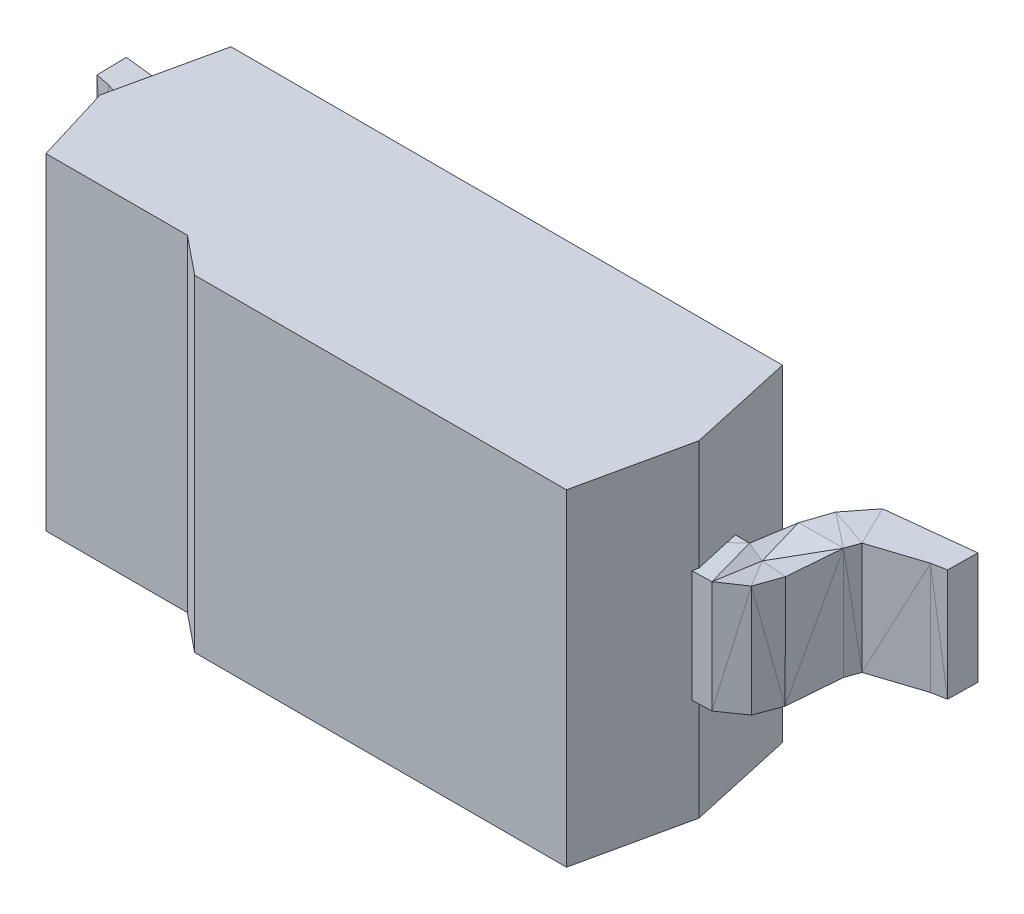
ISO-10303-21;
HEADER;
FILE_DESCRIPTION(('STEP AP214'),'2;1');
FILE_NAME('part.step','',(''),(''),'','','');
FILE_SCHEMA(('AUTOMOTIVE_DESIGN { 1 0 10303 214 1 1 1 1 }'));
ENDSEC;
DATA;
#1=APPLICATION_CONTEXT('core data for automotive mechanical design processes');
#2=APPLICATION_PROTOCOL_DEFINITION('international standard','automotive_design',2000,#1);
#3=PRODUCT_CONTEXT('',#1,'mechanical');
#4=PRODUCT('Part','Part','',(#3));
#5=PRODUCT_RELATED_PRODUCT_CATEGORY('part','',(#4));
#6=PRODUCT_DEFINITION_FORMATION('','',#4);
#7=PRODUCT_DEFINITION_CONTEXT('part definition',#1,'design');
#8=PRODUCT_DEFINITION('design','',#6,#7);
#9=PRODUCT_DEFINITION_SHAPE('','',#8);
#10=(LENGTH_UNIT() NAMED_UNIT(*) SI_UNIT(.MILLI.,.METRE.));
#11=(NAMED_UNIT(*) PLANE_ANGLE_UNIT() SI_UNIT($,.RADIAN.));
#12=(NAMED_UNIT(*) SI_UNIT($,.STERADIAN.) SOLID_ANGLE_UNIT());
#13=UNCERTAINTY_MEASURE_WITH_UNIT(LENGTH_MEASURE(1.E-05),#10,'distance_accuracy_value','');
#14=(GEOMETRIC_REPRESENTATION_CONTEXT(3) GLOBAL_UNCERTAINTY_ASSIGNED_CONTEXT((#13)) GLOBAL_UNIT_ASSIGNED_CONTEXT((#10,
#11,#12)) REPRESENTATION_CONTEXT('',''));
#15=CARTESIAN_POINT('',(0.,0.,0.));
#16=DIRECTION('',(0.,0.,1.));
#17=DIRECTION('',(1.,0.,0.));
#18=AXIS2_PLACEMENT_3D('',#15,#16,#17);
#19=CARTESIAN_POINT('',(1.197581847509,0.261126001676,0.556298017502));
#20=DIRECTION('',(0.999999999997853,0.,2.0721259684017E-06));
#21=DIRECTION('',(2.0721259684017E-06,0.,-0.999999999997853));
#22=AXIS2_PLACEMENT_3D('',#19,#20,#21);
#23=PLANE('',#22);
#24=DIRECTION('',(0.,1.,0.));
#25=VECTOR('',#24,1.);
#26=CARTESIAN_POINT('',(1.19758184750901,0.04135464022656,0.55629801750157));
#27=LINE('',#26,#25);
#28=CARTESIAN_POINT('',(1.19758156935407,-0.289474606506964,0.556298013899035));
#29=VERTEX_POINT('',#28);
#30=CARTESIAN_POINT('',(1.197581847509,0.261126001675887,0.556298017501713));
#31=VERTEX_POINT('',#30);
#32=EDGE_CURVE('P0_E392',#29,#31,#27,.T.);
#33=ORIENTED_EDGE('',*,*,#32,.F.);
#34=DIRECTION('',(0.,-5.03966473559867E-11,1.));
#35=VECTOR('',#34,1.);
#36=CARTESIAN_POINT('',(1.197581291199,-0.289474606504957,0.650703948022));
#37=LINE('',#36,#35);
#38=CARTESIAN_POINT('',(1.19758129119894,-0.289474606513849,0.824771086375));
#39=VERTEX_POINT('',#38);
#40=EDGE_CURVE('P0_E60',#39,#29,#37,.F.);
#41=ORIENTED_EDGE('',*,*,#40,.F.);
#42=DIRECTION('',(0.,1.,0.));
#43=VECTOR('',#42,1.);
#44=CARTESIAN_POINT('',(1.19758129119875,-0.065800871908,0.824771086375));
#45=LINE('',#44,#43);
#46=CARTESIAN_POINT('',(1.19758138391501,0.261126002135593,0.824771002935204));
#47=VERTEX_POINT('',#46);
#48=EDGE_CURVE('P0_E70',#47,#39,#45,.F.);
#49=ORIENTED_EDGE('',*,*,#48,.F.);
#50=DIRECTION('',(-5.09272882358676E-11,1.02725441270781E-08,1.));
#51=VECTOR('',#50,1.);
#52=CARTESIAN_POINT('',(1.19758184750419,0.261126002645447,0.650703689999));
#53=LINE('',#52,#51);
#54=EDGE_CURVE('P0_E416',#31,#47,#53,.T.);
#55=ORIENTED_EDGE('',*,*,#54,.F.);
#56=EDGE_LOOP('',(#33,#41,#49,#55));
#57=FACE_BOUND('',#56,.T.);
#58=ADVANCED_FACE('P0_F17',(#57),#23,.F.);
#59=CARTESIAN_POINT('',(1.404066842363,-0.289476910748,0.736480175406));
#60=DIRECTION('',(7.55059916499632E-07,-0.999999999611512,2.78640575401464E-05));
#61=DIRECTION('',(0.,-2.78640575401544E-05,-0.999999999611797));
#62=AXIS2_PLACEMENT_3D('',#59,#60,#61);
#63=PLANE('',#62);
#64=DIRECTION('',(0.2651770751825,2.70667413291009E-05,0.964199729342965));
#65=VECTOR('',#64,1.);
#66=CARTESIAN_POINT('',(1.491668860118,-0.289481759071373,0.560107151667));
#67=LINE('',#66,#65);
#68=CARTESIAN_POINT('',(1.49166886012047,-0.289481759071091,0.560107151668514));
#69=VERTEX_POINT('',#68);
#70=CARTESIAN_POINT('',(1.56174357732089,-0.289474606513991,0.814903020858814));
#71=VERTEX_POINT('',#70);
#72=EDGE_CURVE('P0_E381',#69,#71,#67,.T.);
#73=ORIENTED_EDGE('',*,*,#72,.T.);
#74=DIRECTION('',(-0.999633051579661,0.,0.0270880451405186));
#75=VECTOR('',#74,1.);
#76=CARTESIAN_POINT('',(1.561743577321,-0.289474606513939,0.814903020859));
#77=LINE('',#76,#75);
#78=EDGE_CURVE('P0_E420',#71,#39,#77,.T.);
#79=ORIENTED_EDGE('',*,*,#78,.T.);
#80=DIRECTION('',(-0.743312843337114,1.80782471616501E-05,0.668943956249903));
#81=VECTOR('',#80,1.);
#82=CARTESIAN_POINT('',(1.491668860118,-0.289481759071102,0.560107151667));
#83=LINE('',#82,#81);
#84=EDGE_CURVE('P0_E397',#69,#39,#83,.T.);
#85=ORIENTED_EDGE('',*,*,#84,.F.);
#86=EDGE_LOOP('',(#73,#79,#85));
#87=FACE_BOUND('',#86,.T.);
#88=ADVANCED_FACE('P0_F586',(#87),#63,.T.);
#89=CARTESIAN_POINT('',(1.643795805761,-0.04535915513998,0.75744627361));
#90=DIRECTION('',(-0.573597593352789,0.,-0.819137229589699));
#91=DIRECTION('',(-0.819137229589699,0.,0.573597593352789));
#92=AXIS2_PLACEMENT_3D('',#89,#90,#91);
#93=PLANE('',#92);
#94=DIRECTION('',(0.819137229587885,0.,-0.57359759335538));
#95=VECTOR('',#94,1.);
#96=CARTESIAN_POINT('',(1.561743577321,-0.289474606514,0.814903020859));
#97=LINE('',#96,#95);
#98=CARTESIAN_POINT('',(1.67589902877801,-0.289474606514,0.734966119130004));
#99=VERTEX_POINT('',#98);
#100=EDGE_CURVE('P0_E378',#71,#99,#97,.T.);
#101=ORIENTED_EDGE('',*,*,#100,.T.);
#102=DIRECTION('',(0.,1.,0.));
#103=VECTOR('',#102,1.);
#104=CARTESIAN_POINT('',(1.67589902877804,-0.04325806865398,0.734966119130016));
#105=LINE('',#104,#103);
#106=CARTESIAN_POINT('',(1.67589902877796,0.259733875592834,0.734966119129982));
#107=VERTEX_POINT('',#106);
#108=EDGE_CURVE('P0_E384',#107,#99,#105,.F.);
#109=ORIENTED_EDGE('',*,*,#108,.F.);
#110=DIRECTION('',(0.201469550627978,0.969281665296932,-0.14107825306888));
#111=VECTOR('',#110,1.);
#112=CARTESIAN_POINT('',(1.56174357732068,-0.289474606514,0.814903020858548));
#113=LINE('',#112,#111);
#114=EDGE_CURVE('P0_E405',#71,#107,#113,.T.);
#115=ORIENTED_EDGE('',*,*,#114,.F.);
#116=EDGE_LOOP('',(#101,#109,#115));
#117=FACE_BOUND('',#116,.T.);
#118=ADVANCED_FACE('P0_F583',(#117),#93,.F.);
#119=CARTESIAN_POINT('',(1.303427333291,0.261650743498,0.650703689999));
#120=DIRECTION('',(-0.00495755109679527,0.999987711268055,-1.02726703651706E-08));
#121=DIRECTION('',(-0.999987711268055,-0.00495755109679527,0.));
#122=AXIS2_PLACEMENT_3D('',#119,#120,#121);
#123=PLANE('',#122);
#124=DIRECTION('',(0.743307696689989,0.00368502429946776,-0.668939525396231));
#125=VECTOR('',#124,1.);
#126=CARTESIAN_POINT('',(1.197581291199,0.261126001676,0.824771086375));
#127=LINE('',#126,#125);
#128=CARTESIAN_POINT('',(1.49166885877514,0.262583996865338,0.560107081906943));
#129=VERTEX_POINT('',#128);
#130=EDGE_CURVE('P0_E366',#47,#129,#127,.T.);
#131=ORIENTED_EDGE('',*,*,#130,.T.);
#132=DIRECTION('',(0.999903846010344,0.00495713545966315,0.0129508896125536));
#133=VECTOR('',#132,1.);
#134=CARTESIAN_POINT('',(1.19758184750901,0.261126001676,0.55629801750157));
#135=LINE('',#134,#133);
#136=EDGE_CURVE('P0_E395',#31,#129,#135,.T.);
#137=ORIENTED_EDGE('',*,*,#136,.F.);
#138=ORIENTED_EDGE('',*,*,#54,.T.);
#139=EDGE_LOOP('',(#131,#137,#138));
#140=FACE_BOUND('',#139,.T.);
#141=ADVANCED_FACE('P0_F548',(#140),#123,.T.);
#142=CARTESIAN_POINT('',(1.443326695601,0.04950634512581,0.818111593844));
#143=DIRECTION('',(-0.0270907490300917,-1.78964123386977E-06,-0.99963297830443));
#144=DIRECTION('',(-0.999632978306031,0.,0.027090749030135));
#145=AXIS2_PLACEMENT_3D('',#142,#143,#144);
#146=PLANE('',#145);
#147=DIRECTION('',(-0.000109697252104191,-0.999999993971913,4.76317101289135E-06));
#148=VECTOR('',#147,1.);
#149=CARTESIAN_POINT('',(1.56180397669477,0.261126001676,0.814900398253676));
#150=LINE('',#149,#148);
#151=CARTESIAN_POINT('',(1.56180397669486,0.261126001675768,0.81490039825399));
#152=VERTEX_POINT('',#151);
#153=EDGE_CURVE('P0_E412',#152,#71,#150,.T.);
#154=ORIENTED_EDGE('',*,*,#153,.F.);
#155=DIRECTION('',(-0.999632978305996,0.,0.0270907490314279));
#156=VECTOR('',#155,1.);
#157=CARTESIAN_POINT('',(1.561803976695,0.261126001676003,0.814900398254));
#158=LINE('',#157,#156);
#159=EDGE_CURVE('P0_E363',#152,#47,#158,.T.);
#160=ORIENTED_EDGE('',*,*,#159,.T.);
#161=ORIENTED_EDGE('',*,*,#48,.T.);
#162=ORIENTED_EDGE('',*,*,#78,.F.);
#163=EDGE_LOOP('',(#154,#160,#161,#162));
#164=FACE_BOUND('',#163,.T.);
#165=ADVANCED_FACE('P0_F553',(#164),#146,.F.);
#166=CARTESIAN_POINT('',(1.593826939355,0.01595827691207,0.792447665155));
#167=DIRECTION('',(0.573788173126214,-5.90419313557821E-05,0.819003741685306));
#168=DIRECTION('',(0.819003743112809,0.,-0.573788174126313));
#169=AXIS2_PLACEMENT_3D('',#166,#167,#168);
#170=PLANE('',#169);
#171=ORIENTED_EDGE('',*,*,#153,.T.);
#172=ORIENTED_EDGE('',*,*,#114,.T.);
#173=DIRECTION('',(-0.818962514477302,0.00999253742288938,0.573760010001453));
#174=VECTOR('',#173,1.);
#175=CARTESIAN_POINT('',(1.67589902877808,0.259733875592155,0.734966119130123));
#176=LINE('',#175,#174);
#177=EDGE_CURVE('P0_E360',#107,#152,#176,.T.);
#178=ORIENTED_EDGE('',*,*,#177,.T.);
#179=EDGE_LOOP('',(#171,#172,#178));
#180=FACE_BOUND('',#179,.T.);
#181=ADVANCED_FACE('P0_F563',(#180),#170,.T.);
#182=CARTESIAN_POINT('',(1.303427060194,-0.289477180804,0.650703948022));
#183=DIRECTION('',(-2.43212276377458E-05,-0.999999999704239,-5.0396647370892E-11));
#184=DIRECTION('',(0.999999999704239,-2.43212276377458E-05,0.));
#185=AXIS2_PLACEMENT_3D('',#182,#183,#184);
#186=PLANE('',#185);
#187=DIRECTION('',(-0.999916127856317,2.43191884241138E-05,-0.0129513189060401));
#188=VECTOR('',#187,1.);
#189=CARTESIAN_POINT('',(1.49166885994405,-0.289481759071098,0.560107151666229));
#190=LINE('',#189,#188);
#191=EDGE_CURVE('P0_E20',#29,#69,#190,.F.);
#192=ORIENTED_EDGE('',*,*,#191,.T.);
#193=ORIENTED_EDGE('',*,*,#84,.T.);
#194=ORIENTED_EDGE('',*,*,#40,.T.);
#195=EDGE_LOOP('',(#192,#193,#194));
#196=FACE_BOUND('',#195,.T.);
#197=ADVANCED_FACE('P0_F540',(#196),#186,.T.);
#198=CARTESIAN_POINT('',(1.68843770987,-0.04325806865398,0.701454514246));
#199=DIRECTION('',(0.936587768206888,0.,0.350433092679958));
#200=DIRECTION('',(0.350433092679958,0.,-0.936587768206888));
#201=AXIS2_PLACEMENT_3D('',#198,#199,#200);
#202=PLANE('',#201);
#203=DIRECTION('',(0.350433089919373,-0.000125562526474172,-0.936587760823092));
#204=VECTOR('',#203,1.);
#205=CARTESIAN_POINT('',(1.675899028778,-0.289474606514,0.73496611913));
#206=LINE('',#205,#204);
#207=CARTESIAN_POINT('',(1.72086922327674,-0.289490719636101,0.614776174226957));
#208=VERTEX_POINT('',#207);
#209=EDGE_CURVE('P0_E351',#99,#208,#206,.T.);
#210=ORIENTED_EDGE('',*,*,#209,.T.);
#211=DIRECTION('',(-0.0797319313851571,0.973772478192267,0.213096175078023));
#212=VECTOR('',#211,1.);
#213=CARTESIAN_POINT('',(1.72086922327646,-0.289490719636,0.614776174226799));
#214=LINE('',#213,#212);
#215=EDGE_CURVE('P0_E369',#208,#107,#214,.T.);
#216=ORIENTED_EDGE('',*,*,#215,.T.);
#217=ORIENTED_EDGE('',*,*,#108,.T.);
#218=EDGE_LOOP('',(#210,#216,#217));
#219=FACE_BOUND('',#218,.T.);
#220=ADVANCED_FACE('P0_F581',(#219),#202,.T.);
#221=CARTESIAN_POINT('',(1.675899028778,-0.289474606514,0.73496611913));
#222=DIRECTION('',(-1.64827904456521E-05,0.999999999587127,-2.3538570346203E-05));
#223=DIRECTION('',(0.,2.35385703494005E-05,0.999999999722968));
#224=AXIS2_PLACEMENT_3D('',#221,#222,#223);
#225=PLANE('',#224);
#226=ORIENTED_EDGE('',*,*,#72,.F.);
#227=DIRECTION('',(0.725313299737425,2.81595844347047E-05,0.688418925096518));
#228=VECTOR('',#227,1.);
#229=CARTESIAN_POINT('',(1.491668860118,-0.289481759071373,0.560107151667));
#230=LINE('',#229,#228);
#231=EDGE_CURVE('P0_E344',#69,#99,#230,.T.);
#232=ORIENTED_EDGE('',*,*,#231,.T.);
#233=ORIENTED_EDGE('',*,*,#100,.F.);
#234=EDGE_LOOP('',(#226,#232,#233));
#235=FACE_BOUND('',#234,.T.);
#236=ADVANCED_FACE('P0_F584',(#235),#225,.F.);
#237=CARTESIAN_POINT('',(1.708430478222,0.01431084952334,0.647660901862));
#238=DIRECTION('',(-0.937814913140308,-0.00082227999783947,-0.347134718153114));
#239=DIRECTION('',(-0.34713483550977,0.,0.937815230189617));
#240=AXIS2_PLACEMENT_3D('',#237,#238,#239);
#241=PLANE('',#240);
#242=DIRECTION('',(0.000693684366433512,0.999990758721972,-0.00424279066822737));
#243=VECTOR('',#242,1.);
#244=CARTESIAN_POINT('',(1.72086922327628,-0.289490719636,0.614776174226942));
#245=LINE('',#244,#243);
#246=CARTESIAN_POINT('',(1.72125116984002,0.261109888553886,0.612440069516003));
#247=VERTEX_POINT('',#246);
#248=EDGE_CURVE('P0_E334',#208,#247,#245,.T.);
#249=ORIENTED_EDGE('',*,*,#248,.T.);
#250=DIRECTION('',(0.347107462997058,0.0105314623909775,-0.937766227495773));
#251=VECTOR('',#250,1.);
#252=CARTESIAN_POINT('',(1.67589902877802,0.259733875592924,0.734966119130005));
#253=LINE('',#252,#251);
#254=EDGE_CURVE('P0_E342',#107,#247,#253,.T.);
#255=ORIENTED_EDGE('',*,*,#254,.F.);
#256=ORIENTED_EDGE('',*,*,#215,.F.);
#257=EDGE_LOOP('',(#249,#255,#256));
#258=FACE_BOUND('',#257,.T.);
#259=ADVANCED_FACE('P0_F671',(#258),#241,.F.);
#260=CARTESIAN_POINT('',(1.197581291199,0.261126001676,0.824771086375));
#261=DIRECTION('',(-0.000153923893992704,-0.999983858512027,-0.00567970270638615));
#262=DIRECTION('',(0.,0.00567970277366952,-0.999983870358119));
#263=AXIS2_PLACEMENT_3D('',#260,#261,#262);
#264=PLANE('',#263);
#265=DIRECTION('',(0.265387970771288,-0.00551688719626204,0.964125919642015));
#266=VECTOR('',#265,1.);
#267=CARTESIAN_POINT('',(1.49166886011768,0.262583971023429,0.560107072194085));
#268=LINE('',#267,#266);
#269=EDGE_CURVE('P0_E329',#129,#152,#268,.T.);
#270=ORIENTED_EDGE('',*,*,#269,.F.);
#271=ORIENTED_EDGE('',*,*,#130,.F.);
#272=ORIENTED_EDGE('',*,*,#159,.F.);
#273=EDGE_LOOP('',(#270,#271,#272));
#274=FACE_BOUND('',#273,.T.);
#275=ADVANCED_FACE('P0_F550',(#274),#264,.F.);
#276=CARTESIAN_POINT('',(1.594466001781,0.246846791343,0.696544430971));
#277=DIRECTION('',(0.0883767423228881,-0.985723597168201,0.143312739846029));
#278=DIRECTION('',(0.,-0.143875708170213,-0.989595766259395));
#279=AXIS2_PLACEMENT_3D('',#276,#277,#278);
#280=PLANE('',#279);
#281=DIRECTION('',(-0.0043176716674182,-0.144253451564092,-0.989531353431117));
#282=VECTOR('',#281,1.);
#283=CARTESIAN_POINT('',(1.56180397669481,0.261126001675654,0.814900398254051));
#284=LINE('',#283,#282);
#285=CARTESIAN_POINT('',(1.56072060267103,0.224930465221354,0.566610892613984));
#286=VERTEX_POINT('',#285);
#287=EDGE_CURVE('P0_E325',#152,#286,#284,.T.);
#288=ORIENTED_EDGE('',*,*,#287,.F.);
#289=ORIENTED_EDGE('',*,*,#177,.F.);
#290=DIRECTION('',(0.55660051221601,0.168187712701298,0.813577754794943));
#291=VECTOR('',#290,1.);
#292=CARTESIAN_POINT('',(1.56072060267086,0.22493046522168,0.566610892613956));
#293=LINE('',#292,#291);
#294=EDGE_CURVE('P0_E339',#286,#107,#293,.T.);
#295=ORIENTED_EDGE('',*,*,#294,.F.);
#296=EDGE_LOOP('',(#288,#289,#295));
#297=FACE_BOUND('',#296,.T.);
#298=ADVANCED_FACE('P0_F566',(#297),#280,.F.);
#299=CARTESIAN_POINT('',(1.399784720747,-0.06861065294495,0.558916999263));
#300=DIRECTION('',(-0.0129513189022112,1.43943356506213E-07,0.999916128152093));
#301=DIRECTION('',(0.999916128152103,0.,0.0129513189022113));
#302=AXIS2_PLACEMENT_3D('',#299,#300,#301);
#303=PLANE('',#302);
#304=DIRECTION('',(-2.1319976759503E-08,1.,-3.22998741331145E-09));
#305=VECTOR('',#304,1.);
#306=CARTESIAN_POINT('',(1.49166885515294,-0.05659543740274,0.560107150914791));
#307=LINE('',#306,#305);
#308=EDGE_CURVE('P0_E322',#69,#129,#307,.T.);
#309=ORIENTED_EDGE('',*,*,#308,.F.);
#310=ORIENTED_EDGE('',*,*,#191,.F.);
#311=ORIENTED_EDGE('',*,*,#32,.T.);
#312=ORIENTED_EDGE('',*,*,#136,.T.);
#313=EDGE_LOOP('',(#309,#310,#311,#312));
#314=FACE_BOUND('',#313,.T.);
#315=ADVANCED_FACE('P0_F544',(#314),#303,.F.);
#316=CARTESIAN_POINT('',(1.675899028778,-0.289474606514,0.73496611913));
#317=DIRECTION('',(6.52487771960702E-05,0.999999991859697,-0.000109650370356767));
#318=DIRECTION('',(0.,0.00010965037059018,0.999999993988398));
#319=AXIS2_PLACEMENT_3D('',#316,#317,#318);
#320=PLANE('',#319);
#321=DIRECTION('',(-0.972712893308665,3.80281118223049E-05,-0.232012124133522));
#322=VECTOR('',#321,1.);
#323=CARTESIAN_POINT('',(1.720869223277,-0.289490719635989,0.614776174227));
#324=LINE('',#323,#322);
#325=EDGE_CURVE('P0_E314',#208,#69,#324,.T.);
#326=ORIENTED_EDGE('',*,*,#325,.F.);
#327=ORIENTED_EDGE('',*,*,#209,.F.);
#328=ORIENTED_EDGE('',*,*,#231,.F.);
#329=EDGE_LOOP('',(#326,#327,#328));
#330=FACE_BOUND('',#329,.T.);
#331=ADVANCED_FACE('P0_F536',(#330),#320,.F.);
#332=CARTESIAN_POINT('',(1.64655630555,0.247212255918,0.63609371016));
#333=DIRECTION('',(-0.202040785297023,0.97729626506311,-0.0638085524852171));
#334=DIRECTION('',(-0.979291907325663,-0.20245335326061,0.));
#335=AXIS2_PLACEMENT_3D('',#332,#333,#334);
#336=PLANE('',#335);
#337=DIRECTION('',(-0.939766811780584,-0.211799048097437,-0.268289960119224));
#338=VECTOR('',#337,1.);
#339=CARTESIAN_POINT('',(1.72125116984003,0.261109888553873,0.612440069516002));
#340=LINE('',#339,#338);
#341=EDGE_CURVE('P0_E304',#247,#286,#340,.T.);
#342=ORIENTED_EDGE('',*,*,#341,.T.);
#343=ORIENTED_EDGE('',*,*,#294,.T.);
#344=ORIENTED_EDGE('',*,*,#254,.T.);
#345=EDGE_LOOP('',(#342,#343,#344));
#346=FACE_BOUND('',#345,.T.);
#347=ADVANCED_FACE('P0_F573',(#346),#336,.T.);
#348=CARTESIAN_POINT('',(1.72125116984,0.261109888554,0.612440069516));
#349=DIRECTION('',(-0.996812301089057,0.00035297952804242,-0.0797816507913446));
#350=DIRECTION('',(-0.0797816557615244,0.,0.996812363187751));
#351=AXIS2_PLACEMENT_3D('',#348,#349,#350);
#352=PLANE('',#351);
#353=DIRECTION('',(0.0351061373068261,0.899918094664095,-0.434643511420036));
#354=VECTOR('',#353,1.);
#355=CARTESIAN_POINT('',(1.72086922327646,-0.289490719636,0.614776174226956));
#356=LINE('',#355,#354);
#357=CARTESIAN_POINT('',(1.74234898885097,0.26112610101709,0.348838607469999));
#358=VERTEX_POINT('',#357);
#359=EDGE_CURVE('P0_E309',#208,#358,#356,.T.);
#360=ORIENTED_EDGE('',*,*,#359,.T.);
#361=DIRECTION('',(-0.0797816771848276,-6.13076416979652E-05,0.996812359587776));
#362=VECTOR('',#361,1.);
#363=CARTESIAN_POINT('',(1.74234898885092,0.261126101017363,0.348838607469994));
#364=LINE('',#363,#362);
#365=EDGE_CURVE('P0_E299',#358,#247,#364,.T.);
#366=ORIENTED_EDGE('',*,*,#365,.T.);
#367=ORIENTED_EDGE('',*,*,#248,.F.);
#368=EDGE_LOOP('',(#360,#366,#367));
#369=FACE_BOUND('',#368,.T.);
#370=ADVANCED_FACE('P0_F578',(#369),#352,.F.);
#371=CARTESIAN_POINT('',(1.541246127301,0.251499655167,0.672386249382));
#372=DIRECTION('',(0.484074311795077,0.865570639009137,-0.12829469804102));
#373=DIRECTION('',(-0.872783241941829,0.488107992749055,0.));
#374=AXIS2_PLACEMENT_3D('',#371,#372,#373);
#375=PLANE('',#374);
#376=ORIENTED_EDGE('',*,*,#287,.T.);
#377=DIRECTION('',(-0.87496835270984,0.477115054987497,-0.0824112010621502));
#378=VECTOR('',#377,1.);
#379=CARTESIAN_POINT('',(1.56072060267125,0.224930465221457,0.566610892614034));
#380=LINE('',#379,#378);
#381=EDGE_CURVE('P0_E290',#286,#129,#380,.T.);
#382=ORIENTED_EDGE('',*,*,#381,.T.);
#383=ORIENTED_EDGE('',*,*,#269,.T.);
#384=EDGE_LOOP('',(#376,#382,#383));
#385=FACE_BOUND('',#384,.T.);
#386=ADVANCED_FACE('P0_F558',(#385),#375,.T.);
#387=CARTESIAN_POINT('',(1.501070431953,-0.05659543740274,0.498050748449));
#388=DIRECTION('',(-0.988717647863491,-2.15632610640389E-08,-0.149791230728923));
#389=DIRECTION('',(-0.149791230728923,0.,0.988717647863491));
#390=AXIS2_PLACEMENT_3D('',#387,#388,#389);
#391=PLANE('',#390);
#392=DIRECTION('',(-0.149791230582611,4.38042004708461E-05,0.988717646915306));
#393=VECTOR('',#392,1.);
#394=CARTESIAN_POINT('',(1.523397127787,-0.289491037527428,0.350680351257));
#395=LINE('',#394,#393);
#396=CARTESIAN_POINT('',(1.52339712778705,-0.289491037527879,0.350680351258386));
#397=VERTEX_POINT('',#396);
#398=EDGE_CURVE('P0_E319',#69,#397,#395,.F.);
#399=ORIENTED_EDGE('',*,*,#398,.F.);
#400=ORIENTED_EDGE('',*,*,#308,.T.);
#401=DIRECTION('',(0.0536571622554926,-0.933639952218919,-0.354171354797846));
#402=VECTOR('',#401,1.);
#403=CARTESIAN_POINT('',(1.49166886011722,0.262583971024,0.560107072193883));
#404=LINE('',#403,#402);
#405=EDGE_CURVE('P0_E287',#129,#397,#404,.T.);
#406=ORIENTED_EDGE('',*,*,#405,.T.);
#407=EDGE_LOOP('',(#399,#400,#406));
#408=FACE_BOUND('',#407,.T.);
#409=ADVANCED_FACE('P0_F447',(#408),#391,.T.);
#410=CARTESIAN_POINT('',(1.586090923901,-0.289488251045,0.507025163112));
#411=DIRECTION('',(-4.79303206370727E-05,-0.999999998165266,3.70425862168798E-05));
#412=DIRECTION('',(0.999999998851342,-4.79303206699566E-05,0.));
#413=AXIS2_PLACEMENT_3D('',#410,#411,#412);
#414=PLANE('',#413);
#415=DIRECTION('',(0.598835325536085,9.64007713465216E-07,0.800872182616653));
#416=VECTOR('',#415,1.);
#417=CARTESIAN_POINT('',(1.523397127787,-0.289491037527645,0.350680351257));
#418=LINE('',#417,#416);
#419=EDGE_CURVE('P0_E277',#397,#208,#418,.T.);
#420=ORIENTED_EDGE('',*,*,#419,.T.);
#421=ORIENTED_EDGE('',*,*,#325,.T.);
#422=ORIENTED_EDGE('',*,*,#398,.T.);
#423=EDGE_LOOP('',(#420,#421,#422));
#424=FACE_BOUND('',#423,.T.);
#425=ADVANCED_FACE('P0_F439',(#424),#414,.T.);
#426=CARTESIAN_POINT('',(1.735744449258,-0.06556285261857,0.430594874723));
#427=DIRECTION('',(-0.996755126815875,6.89863032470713E-06,-0.0804935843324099));
#428=DIRECTION('',(-0.0804935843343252,0.,0.996755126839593));
#429=AXIS2_PLACEMENT_3D('',#426,#427,#428);
#430=PLANE('',#429);
#431=DIRECTION('',(1.38564947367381E-05,0.999999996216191,-8.58813984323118E-05));
#432=VECTOR('',#431,1.);
#433=CARTESIAN_POINT('',(1.74234135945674,-0.289474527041,0.348885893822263));
#434=LINE('',#433,#432);
#435=CARTESIAN_POINT('',(1.74234135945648,-0.289474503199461,0.348885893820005));
#436=VERTEX_POINT('',#435);
#437=EDGE_CURVE('P0_E265',#436,#358,#434,.T.);
#438=ORIENTED_EDGE('',*,*,#437,.T.);
#439=ORIENTED_EDGE('',*,*,#359,.F.);
#440=DIRECTION('',(0.0804935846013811,6.07019263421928E-05,-0.996755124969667));
#441=VECTOR('',#440,1.);
#442=CARTESIAN_POINT('',(1.720869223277,-0.289490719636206,0.614776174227));
#443=LINE('',#442,#441);
#444=EDGE_CURVE('P0_E274',#208,#436,#443,.T.);
#445=ORIENTED_EDGE('',*,*,#444,.T.);
#446=EDGE_LOOP('',(#438,#439,#445));
#447=FACE_BOUND('',#446,.T.);
#448=ADVANCED_FACE('P0_F529',(#447),#430,.F.);
#449=CARTESIAN_POINT('',(1.678469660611,0.249659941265,0.497347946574));
#450=DIRECTION('',(0.215162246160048,-0.976427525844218,0.0171608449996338));
#451=DIRECTION('',(0.97657133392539,0.21519393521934,0.));
#452=AXIS2_PLACEMENT_3D('',#449,#450,#451);
#453=PLANE('',#452);
#454=DIRECTION('',(-0.635344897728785,-0.126614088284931,0.761778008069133));
#455=VECTOR('',#454,1.);
#456=CARTESIAN_POINT('',(1.742348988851,0.261126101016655,0.348838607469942));
#457=LINE('',#456,#455);
#458=EDGE_CURVE('P0_E262',#358,#286,#457,.T.);
#459=ORIENTED_EDGE('',*,*,#458,.T.);
#460=ORIENTED_EDGE('',*,*,#341,.F.);
#461=ORIENTED_EDGE('',*,*,#365,.F.);
#462=EDGE_LOOP('',(#459,#460,#461));
#463=FACE_BOUND('',#462,.T.);
#464=ADVANCED_FACE('P0_F577',(#463),#453,.F.);
#465=CARTESIAN_POINT('',(1.525317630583,0.250906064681,0.473651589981));
#466=DIRECTION('',(-0.472963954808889,-0.878651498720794,-0.0653960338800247));
#467=DIRECTION('',(0.880536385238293,-0.473978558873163,0.));
#468=AXIS2_PLACEMENT_3D('',#465,#466,#467);
#469=PLANE('',#468);
#470=DIRECTION('',(-0.168839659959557,0.163229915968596,-0.97203351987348));
#471=VECTOR('',#470,1.);
#472=CARTESIAN_POINT('',(1.560720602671,0.224930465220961,0.566610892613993));
#473=LINE('',#472,#471);
#474=CARTESIAN_POINT('',(1.52329810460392,0.26110959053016,0.351164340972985));
#475=VERTEX_POINT('',#474);
#476=EDGE_CURVE('P0_E259',#286,#475,#473,.T.);
#477=ORIENTED_EDGE('',*,*,#476,.T.);
#478=DIRECTION('',(-0.149668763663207,0.00697673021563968,0.988711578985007));
#479=VECTOR('',#478,1.);
#480=CARTESIAN_POINT('',(1.52329810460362,0.26110959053,0.351164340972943));
#481=LINE('',#480,#479);
#482=EDGE_CURVE('P0_E280',#475,#129,#481,.T.);
#483=ORIENTED_EDGE('',*,*,#482,.T.);
#484=ORIENTED_EDGE('',*,*,#381,.F.);
#485=EDGE_LOOP('',(#477,#483,#484));
#486=FACE_BOUND('',#485,.T.);
#487=ADVANCED_FACE('P0_F570',(#486),#469,.F.);
#488=CARTESIAN_POINT('',(1.513959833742,0.02923858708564,0.41292473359));
#489=DIRECTION('',(0.988735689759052,4.62549498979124E-05,0.149672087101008));
#490=DIRECTION('',(0.149672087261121,0.,-0.988735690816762));
#491=AXIS2_PLACEMENT_3D('',#488,#489,#490);
#492=PLANE('',#491);
#493=DIRECTION('',(-0.000179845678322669,0.999999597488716,0.000879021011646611));
#494=VECTOR('',#493,1.);
#495=CARTESIAN_POINT('',(1.52339712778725,-0.289491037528,0.350680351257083));
#496=LINE('',#495,#494);
#497=EDGE_CURVE('P0_E249',#397,#475,#496,.T.);
#498=ORIENTED_EDGE('',*,*,#497,.F.);
#499=ORIENTED_EDGE('',*,*,#405,.F.);
#500=ORIENTED_EDGE('',*,*,#482,.F.);
#501=EDGE_LOOP('',(#498,#499,#500));
#502=FACE_BOUND('',#501,.T.);
#503=ADVANCED_FACE('P0_F457',(#502),#492,.F.);
#504=CARTESIAN_POINT('',(1.66082631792,-0.289486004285,0.446739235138));
#505=DIRECTION('',(-7.49600362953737E-05,0.99999999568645,5.48460927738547E-05));
#506=DIRECTION('',(-0.999999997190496,-7.49600364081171E-05,0.));
#507=AXIS2_PLACEMENT_3D('',#504,#505,#506);
#508=PLANE('',#507);
#509=ORIENTED_EDGE('',*,*,#444,.F.);
#510=ORIENTED_EDGE('',*,*,#419,.F.);
#511=DIRECTION('',(0.999966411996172,7.54070199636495E-05,-0.00819568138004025));
#512=VECTOR('',#511,1.);
#513=CARTESIAN_POINT('',(1.523397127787,-0.289491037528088,0.350680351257));
#514=LINE('',#513,#512);
#515=EDGE_CURVE('P0_E244',#397,#436,#514,.T.);
#516=ORIENTED_EDGE('',*,*,#515,.T.);
#517=EDGE_LOOP('',(#509,#510,#516));
#518=FACE_BOUND('',#517,.T.);
#519=ADVANCED_FACE('P0_F444',(#518),#508,.F.);
#520=CARTESIAN_POINT('',(1.748678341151,-0.03085942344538,0.330964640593));
#521=DIRECTION('',(-0.942724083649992,-1.55849102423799E-05,-0.333573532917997));
#522=DIRECTION('',(-0.333573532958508,0.,0.942724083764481));
#523=AXIS2_PLACEMENT_3D('',#520,#521,#522);
#524=PLANE('',#523);
#525=ORIENTED_EDGE('',*,*,#437,.F.);
#526=DIRECTION('',(0.333573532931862,1.67091987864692E-06,-0.942724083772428));
#527=VECTOR('',#526,1.);
#528=CARTESIAN_POINT('',(1.742341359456,-0.28947452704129,0.348885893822));
#529=LINE('',#528,#527);
#530=CARTESIAN_POINT('',(1.76613966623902,-0.289474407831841,0.281628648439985));
#531=VERTEX_POINT('',#530);
#532=EDGE_CURVE('P0_E254',#436,#531,#529,.T.);
#533=ORIENTED_EDGE('',*,*,#532,.T.);
#534=DIRECTION('',(-0.0428508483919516,0.991720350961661,0.121055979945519));
#535=VECTOR('',#534,1.);
#536=CARTESIAN_POINT('',(1.76613966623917,-0.289474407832,0.281628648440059));
#537=LINE('',#536,#535);
#538=EDGE_CURVE('P0_E234',#531,#358,#537,.T.);
#539=ORIENTED_EDGE('',*,*,#538,.T.);
#540=EDGE_LOOP('',(#525,#533,#539));
#541=FACE_BOUND('',#540,.T.);
#542=ADVANCED_FACE('P0_F640',(#541),#524,.F.);
#543=CARTESIAN_POINT('',(1.612482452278,0.248479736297,0.425601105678));
#544=DIRECTION('',(-0.00168095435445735,-0.986238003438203,-0.165323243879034));
#545=DIRECTION('',(0.,0.165323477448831,-0.986239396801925));
#546=AXIS2_PLACEMENT_3D('',#543,#544,#545);
#547=PLANE('',#546);
#548=ORIENTED_EDGE('',*,*,#458,.F.);
#549=DIRECTION('',(-0.999943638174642,-7.53685888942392E-05,0.0106167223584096));
#550=VECTOR('',#549,1.);
#551=CARTESIAN_POINT('',(1.742348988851,0.261126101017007,0.34883860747));
#552=LINE('',#551,#550);
#553=EDGE_CURVE('P0_E229',#358,#475,#552,.T.);
#554=ORIENTED_EDGE('',*,*,#553,.T.);
#555=ORIENTED_EDGE('',*,*,#476,.F.);
#556=EDGE_LOOP('',(#548,#554,#555));
#557=FACE_BOUND('',#556,.T.);
#558=ADVANCED_FACE('P0_F576',(#557),#547,.F.);
#559=CARTESIAN_POINT('',(1.766139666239,-0.289474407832,0.28162864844));
#560=DIRECTION('',(0.000110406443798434,0.999999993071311,4.08386589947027E-05));
#561=DIRECTION('',(-0.999999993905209,0.000110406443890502,0.));
#562=AXIS2_PLACEMENT_3D('',#559,#560,#561);
#563=PLANE('',#562);
#564=DIRECTION('',(-0.788811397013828,0.000112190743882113,-0.614635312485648));
#565=VECTOR('',#564,1.);
#566=CARTESIAN_POINT('',(1.742341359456,-0.289474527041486,0.348885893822));
#567=LINE('',#566,#565);
#568=CARTESIAN_POINT('',(1.56954097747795,-0.289449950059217,0.214241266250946));
#569=VERTEX_POINT('',#568);
#570=EDGE_CURVE('P0_E239',#436,#569,#567,.T.);
#571=ORIENTED_EDGE('',*,*,#570,.T.);
#572=DIRECTION('',(0.945972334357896,-0.000117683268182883,0.32424732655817));
#573=VECTOR('',#572,1.);
#574=CARTESIAN_POINT('',(1.569540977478,-0.289449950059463,0.214241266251));
#575=LINE('',#574,#573);
#576=EDGE_CURVE('P0_E197',#569,#531,#575,.T.);
#577=ORIENTED_EDGE('',*,*,#576,.T.);
#578=ORIENTED_EDGE('',*,*,#532,.F.);
#579=EDGE_LOOP('',(#571,#577,#578));
#580=FACE_BOUND('',#579,.T.);
#581=ADVANCED_FACE('P0_F526',(#580),#563,.F.);
#582=CARTESIAN_POINT('',(1.536393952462,0.01729048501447,0.312303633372));
#583=DIRECTION('',(-0.947426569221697,0.000110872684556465,-0.319973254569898));
#584=DIRECTION('',(-0.319973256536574,0.,0.947426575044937));
#585=AXIS2_PLACEMENT_3D('',#582,#583,#584);
#586=PLANE('',#585);
#587=ORIENTED_EDGE('',*,*,#497,.T.);
#588=DIRECTION('',(0.319973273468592,0.000284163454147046,-0.947426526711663));
#589=VECTOR('',#588,1.);
#590=CARTESIAN_POINT('',(1.523298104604,0.261109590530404,0.351164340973));
#591=LINE('',#590,#589);
#592=CARTESIAN_POINT('',(1.56954097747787,0.261150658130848,0.214241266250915));
#593=VERTEX_POINT('',#592);
#594=EDGE_CURVE('P0_E224',#475,#593,#591,.T.);
#595=ORIENTED_EDGE('',*,*,#594,.T.);
#596=DIRECTION('',(-0.0810725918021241,-0.967451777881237,0.239717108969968));
#597=VECTOR('',#596,1.);
#598=CARTESIAN_POINT('',(1.569540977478,0.261150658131,0.214241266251));
#599=LINE('',#598,#597);
#600=EDGE_CURVE('P0_E194',#593,#397,#599,.T.);
#601=ORIENTED_EDGE('',*,*,#600,.T.);
#602=EDGE_LOOP('',(#587,#595,#601));
#603=FACE_BOUND('',#602,.T.);
#604=ADVANCED_FACE('P0_F462',(#603),#586,.T.);
#605=CARTESIAN_POINT('',(1.620172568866,-0.289472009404,0.3074481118));
#606=DIRECTION('',(-7.3144154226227E-05,0.99999995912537,0.000276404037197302));
#607=DIRECTION('',(0.,-0.000276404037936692,0.999999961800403));
#608=AXIS2_PLACEMENT_3D('',#605,#606,#607);
#609=PLANE('',#608);
#610=ORIENTED_EDGE('',*,*,#515,.F.);
#611=DIRECTION('',(0.320374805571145,0.000285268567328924,-0.947290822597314));
#612=VECTOR('',#611,1.);
#613=CARTESIAN_POINT('',(1.52339712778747,-0.289491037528,0.350680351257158));
#614=LINE('',#613,#612);
#615=EDGE_CURVE('P0_E191',#397,#569,#614,.T.);
#616=ORIENTED_EDGE('',*,*,#615,.T.);
#617=ORIENTED_EDGE('',*,*,#570,.F.);
#618=EDGE_LOOP('',(#610,#616,#617));
#619=FACE_BOUND('',#618,.T.);
#620=ADVANCED_FACE('P0_F454',(#619),#609,.F.);
#621=CARTESIAN_POINT('',(1.759808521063,0.002500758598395,0.299514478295));
#622=DIRECTION('',(-0.942683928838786,0.,-0.333686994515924));
#623=DIRECTION('',(-0.333686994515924,0.,0.942683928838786));
#624=AXIS2_PLACEMENT_3D('',#621,#622,#623);
#625=PLANE('',#624);
#626=ORIENTED_EDGE('',*,*,#538,.F.);
#627=DIRECTION('',(0.,1.,0.));
#628=VECTOR('',#627,1.);
#629=CARTESIAN_POINT('',(1.76613966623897,0.037304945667,0.281628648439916));
#630=LINE('',#629,#628);
#631=CARTESIAN_POINT('',(1.76613966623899,0.261126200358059,0.281628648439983));
#632=VERTEX_POINT('',#631);
#633=EDGE_CURVE('P0_E209',#531,#632,#630,.T.);
#634=ORIENTED_EDGE('',*,*,#633,.T.);
#635=DIRECTION('',(-0.333686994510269,-1.39335354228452E-06,0.942683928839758));
#636=VECTOR('',#635,1.);
#637=CARTESIAN_POINT('',(1.766139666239,0.261126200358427,0.28162864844));
#638=LINE('',#637,#636);
#639=EDGE_CURVE('P0_E186',#632,#358,#638,.T.);
#640=ORIENTED_EDGE('',*,*,#639,.T.);
#641=EDGE_LOOP('',(#626,#634,#640));
#642=FACE_BOUND('',#641,.T.);
#643=ADVANCED_FACE('P0_F520',(#642),#625,.F.);
#644=CARTESIAN_POINT('',(1.620083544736,0.26112861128,0.307569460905));
#645=DIRECTION('',(7.24481435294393E-05,-0.999999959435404,-0.000275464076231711));
#646=DIRECTION('',(0.,0.00027546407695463,-0.999999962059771));
#647=AXIS2_PLACEMENT_3D('',#644,#645,#646);
#648=PLANE('',#647);
#649=ORIENTED_EDGE('',*,*,#553,.F.);
#650=DIRECTION('',(-0.788929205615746,0.000112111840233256,-0.614484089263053));
#651=VECTOR('',#650,1.);
#652=CARTESIAN_POINT('',(1.742348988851,0.261126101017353,0.34883860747));
#653=LINE('',#652,#651);
#654=EDGE_CURVE('P0_E149',#358,#593,#653,.T.);
#655=ORIENTED_EDGE('',*,*,#654,.T.);
#656=ORIENTED_EDGE('',*,*,#594,.F.);
#657=EDGE_LOOP('',(#649,#655,#656));
#658=FACE_BOUND('',#657,.T.);
#659=ADVANCED_FACE('P0_F475',(#658),#648,.F.);
#660=CARTESIAN_POINT('',(1.942275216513,-0.06566279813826,0.224377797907));
#661=DIRECTION('',(0.309078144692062,3.57787215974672E-05,0.951036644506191));
#662=DIRECTION('',(0.95103664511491,0.,-0.30907814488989));
#663=AXIS2_PLACEMENT_3D('',#660,#661,#662);
#664=PLANE('',#663);
#665=DIRECTION('',(-0.000115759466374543,0.999999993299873,-1.61714501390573E-13));
#666=VECTOR('',#665,1.);
#667=CARTESIAN_POINT('',(2.0205275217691,-0.289474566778,0.198954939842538));
#668=LINE('',#667,#666);
#669=CARTESIAN_POINT('',(2.0205275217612,-0.289474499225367,0.198954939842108));
#670=VERTEX_POINT('',#669);
#671=CARTESIAN_POINT('',(2.02046379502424,0.261126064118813,0.198954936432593));
#672=VERTEX_POINT('',#671);
#673=EDGE_CURVE('P0_E219',#670,#672,#668,.T.);
#674=ORIENTED_EDGE('',*,*,#673,.T.);
#675=DIRECTION('',(-0.415488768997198,-0.899514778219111,0.135063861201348));
#676=VECTOR('',#675,1.);
#677=CARTESIAN_POINT('',(2.02046378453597,0.261126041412,0.198954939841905));
#678=LINE('',#677,#676);
#679=EDGE_CURVE('P0_E214',#672,#531,#678,.T.);
#680=ORIENTED_EDGE('',*,*,#679,.T.);
#681=DIRECTION('',(0.951036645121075,-5.94223350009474E-07,-0.309078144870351));
#682=VECTOR('',#681,1.);
#683=CARTESIAN_POINT('',(1.766139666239,-0.289474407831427,0.28162864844));
#684=LINE('',#683,#682);
#685=EDGE_CURVE('P0_E148',#531,#670,#684,.T.);
#686=ORIENTED_EDGE('',*,*,#685,.T.);
#687=EDGE_LOOP('',(#674,#680,#686));
#688=FACE_BOUND('',#687,.T.);
#689=ADVANCED_FACE('P0_F515',(#688),#664,.T.);
#690=CARTESIAN_POINT('',(2.039099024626,-0.03082434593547,0.195381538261));
#691=DIRECTION('',(-0.188653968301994,-2.18384830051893E-05,-0.982043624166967));
#692=DIRECTION('',(-0.982043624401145,0.,0.18865396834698));
#693=AXIS2_PLACEMENT_3D('',#690,#691,#692);
#694=PLANE('',#693);
#695=ORIENTED_EDGE('',*,*,#673,.F.);
#696=DIRECTION('',(-0.982043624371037,-4.74491639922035E-06,0.188653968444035));
#697=VECTOR('',#696,1.);
#698=CARTESIAN_POINT('',(2.090432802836,-0.289474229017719,0.185525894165));
#699=LINE('',#698,#697);
#700=CARTESIAN_POINT('',(2.09043280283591,-0.289474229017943,0.185525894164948));
#701=VERTEX_POINT('',#700);
#702=EDGE_CURVE('P0_E168',#701,#670,#699,.T.);
#703=ORIENTED_EDGE('',*,*,#702,.F.);
#704=DIRECTION('',(-0.126027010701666,0.99173188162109,0.0241881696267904));
#705=VECTOR('',#704,1.);
#706=CARTESIAN_POINT('',(2.09043280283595,-0.289474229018,0.185525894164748));
#707=LINE('',#706,#705);
#708=EDGE_CURVE('P0_E145',#701,#672,#707,.T.);
#709=ORIENTED_EDGE('',*,*,#708,.T.);
#710=EDGE_LOOP('',(#695,#703,#709));
#711=FACE_BOUND('',#710,.T.);
#712=ADVANCED_FACE('P0_F623',(#711),#694,.F.);
#713=CARTESIAN_POINT('',(1.844344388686,0.037304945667,0.256206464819));
#714=DIRECTION('',(-0.309148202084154,0.,-0.951013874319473));
#715=DIRECTION('',(-0.951013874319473,0.,0.309148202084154));
#716=AXIS2_PLACEMENT_3D('',#713,#714,#715);
#717=PLANE('',#716);
#718=ORIENTED_EDGE('',*,*,#679,.F.);
#719=DIRECTION('',(0.951013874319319,-5.94358039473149E-07,-0.309148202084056));
#720=VECTOR('',#719,1.);
#721=CARTESIAN_POINT('',(1.766139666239,0.261126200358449,0.28162864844));
#722=LINE('',#721,#720);
#723=EDGE_CURVE('P0_E138',#632,#672,#722,.T.);
#724=ORIENTED_EDGE('',*,*,#723,.F.);
#725=ORIENTED_EDGE('',*,*,#633,.F.);
#726=EDGE_LOOP('',(#718,#724,#725));
#727=FACE_BOUND('',#726,.T.);
#728=ADVANCED_FACE('P0_F518',(#727),#717,.F.);
#729=CARTESIAN_POINT('',(2.071813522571,0.002489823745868,0.189099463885));
#730=DIRECTION('',(-0.18848822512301,0.,-0.98207544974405));
#731=DIRECTION('',(-0.98207544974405,0.,0.18848822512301));
#732=AXIS2_PLACEMENT_3D('',#729,#730,#731);
#733=PLANE('',#732);
#734=ORIENTED_EDGE('',*,*,#708,.F.);
#735=DIRECTION('',(0.,1.,0.));
#736=VECTOR('',#735,1.);
#737=CARTESIAN_POINT('',(2.09043280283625,0.01776202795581,0.185525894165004));
#738=LINE('',#737,#736);
#739=CARTESIAN_POINT('',(2.09043280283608,0.261126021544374,0.185525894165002));
#740=VERTEX_POINT('',#739);
#741=EDGE_CURVE('P0_E143',#701,#740,#738,.T.);
#742=ORIENTED_EDGE('',*,*,#741,.T.);
#743=DIRECTION('',(0.982075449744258,-2.78867512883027E-07,-0.188488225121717));
#744=VECTOR('',#743,1.);
#745=CARTESIAN_POINT('',(2.020463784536,0.261126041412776,0.198954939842));
#746=LINE('',#745,#744);
#747=EDGE_CURVE('P0_E129',#672,#740,#746,.T.);
#748=ORIENTED_EDGE('',*,*,#747,.F.);
#749=EDGE_LOOP('',(#734,#742,#748));
#750=FACE_BOUND('',#749,.T.);
#751=ADVANCED_FACE('P0_F144',(#750),#733,.F.);
#752=CARTESIAN_POINT('',(1.673840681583,-0.289464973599,0.196717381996));
#753=DIRECTION('',(0.000137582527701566,0.999999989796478,-3.84459543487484E-05));
#754=DIRECTION('',(-0.999999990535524,0.000137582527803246,0.));
#755=AXIS2_PLACEMENT_3D('',#752,#753,#754);
#756=PLANE('',#755);
#757=DIRECTION('',(-0.625802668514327,0.000116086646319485,0.779981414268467));
#758=VECTOR('',#757,1.);
#759=CARTESIAN_POINT('',(1.67300542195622,-0.289469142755,0.0852863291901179));
#760=LINE('',#759,#758);
#761=CARTESIAN_POINT('',(1.67300542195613,-0.289469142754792,0.0852863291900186));
#762=VERTEX_POINT('',#761);
#763=EDGE_CURVE('P0_E155',#762,#569,#760,.T.);
#764=ORIENTED_EDGE('',*,*,#763,.F.);
#765=DIRECTION('',(0.428574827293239,-2.42282467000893E-05,0.903506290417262));
#766=VECTOR('',#765,1.);
#767=CARTESIAN_POINT('',(1.673005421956,-0.289469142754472,0.08528632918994));
#768=LINE('',#767,#766);
#769=EDGE_CURVE('P0_E35',#762,#531,#768,.T.);
#770=ORIENTED_EDGE('',*,*,#769,.T.);
#771=ORIENTED_EDGE('',*,*,#576,.F.);
#772=EDGE_LOOP('',(#764,#770,#771));
#773=FACE_BOUND('',#772,.T.);
#774=ADVANCED_FACE('P0_F523',(#773),#756,.F.);
#775=CARTESIAN_POINT('',(1.569540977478,0.261150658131,0.214241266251));
#776=DIRECTION('',(0.947290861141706,0.,0.320374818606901));
#777=DIRECTION('',(0.320374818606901,0.,-0.947290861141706));
#778=AXIS2_PLACEMENT_3D('',#775,#776,#777);
#779=PLANE('',#778);
#780=ORIENTED_EDGE('',*,*,#615,.F.);
#781=ORIENTED_EDGE('',*,*,#600,.F.);
#782=DIRECTION('',(0.,1.,0.));
#783=VECTOR('',#782,1.);
#784=CARTESIAN_POINT('',(1.56954097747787,-0.0494156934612,0.214241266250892));
#785=LINE('',#784,#783);
#786=EDGE_CURVE('P0_E158',#569,#593,#785,.T.);
#787=ORIENTED_EDGE('',*,*,#786,.F.);
#788=EDGE_LOOP('',(#780,#781,#787));
#789=FACE_BOUND('',#788,.T.);
#790=ADVANCED_FACE('P0_F460',(#789),#779,.F.);
#791=CARTESIAN_POINT('',(1.569540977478,0.261150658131,0.214241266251));
#792=DIRECTION('',(-0.000110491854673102,-0.999999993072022,-4.05894778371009E-05));
#793=DIRECTION('',(0.999999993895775,-0.00011049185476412,0.));
#794=AXIS2_PLACEMENT_3D('',#791,#792,#793);
#795=PLANE('',#794);
#796=ORIENTED_EDGE('',*,*,#639,.F.);
#797=DIRECTION('',(-0.945972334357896,0.000117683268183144,-0.324247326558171));
#798=VECTOR('',#797,1.);
#799=CARTESIAN_POINT('',(1.766139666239,0.261126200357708,0.28162864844));
#800=LINE('',#799,#798);
#801=EDGE_CURVE('P0_E486',#632,#593,#800,.T.);
#802=ORIENTED_EDGE('',*,*,#801,.T.);
#803=ORIENTED_EDGE('',*,*,#654,.F.);
#804=EDGE_LOOP('',(#796,#802,#803));
#805=FACE_BOUND('',#804,.T.);
#806=ADVANCED_FACE('P0_F487',(#805),#795,.F.);
#807=CARTESIAN_POINT('',(1.599207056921,-0.0494156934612,0.177266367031));
#808=DIRECTION('',(-0.779981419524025,0.,-0.62580267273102));
#809=DIRECTION('',(-0.62580267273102,0.,0.779981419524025));
#810=AXIS2_PLACEMENT_3D('',#807,#808,#809);
#811=PLANE('',#810);
#812=ORIENTED_EDGE('',*,*,#763,.T.);
#813=ORIENTED_EDGE('',*,*,#786,.T.);
#814=DIRECTION('',(0.1799677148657,-0.957756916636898,-0.224306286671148));
#815=VECTOR('',#814,1.);
#816=CARTESIAN_POINT('',(1.56954097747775,0.261150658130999,0.214241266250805));
#817=LINE('',#816,#815);
#818=EDGE_CURVE('P0_E470',#593,#762,#817,.T.);
#819=ORIENTED_EDGE('',*,*,#818,.T.);
#820=EDGE_LOOP('',(#812,#813,#819));
#821=FACE_BOUND('',#820,.T.);
#822=ADVANCED_FACE('P0_F468',(#821),#811,.T.);
#823=CARTESIAN_POINT('',(1.673258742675,0.261135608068,0.196815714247));
#824=DIRECTION('',(-0.00013829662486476,-0.99999998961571,4.05292905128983E-05));
#825=DIRECTION('',(0.999999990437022,-0.000138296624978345,0.));
#826=AXIS2_PLACEMENT_3D('',#823,#824,#825);
#827=PLANE('',#826);
#828=DIRECTION('',(0.437810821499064,-2.4109206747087E-05,0.899067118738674));
#829=VECTOR('',#828,1.);
#830=CARTESIAN_POINT('',(1.670528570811,0.261131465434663,0.08528632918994));
#831=LINE('',#830,#829);
#832=CARTESIAN_POINT('',(1.67052857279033,0.26113146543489,0.0852863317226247));
#833=VERTEX_POINT('',#832);
#834=EDGE_CURVE('P0_E472',#833,#632,#831,.T.);
#835=ORIENTED_EDGE('',*,*,#834,.F.);
#836=DIRECTION('',(-0.616559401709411,0.00011717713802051,0.787308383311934));
#837=VECTOR('',#836,1.);
#838=CARTESIAN_POINT('',(1.67052857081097,0.261131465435,0.0852863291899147));
#839=LINE('',#838,#837);
#840=EDGE_CURVE('P0_E435',#833,#593,#839,.T.);
#841=ORIENTED_EDGE('',*,*,#840,.T.);
#842=ORIENTED_EDGE('',*,*,#801,.F.);
#843=EDGE_LOOP('',(#835,#841,#842));
#844=FACE_BOUND('',#843,.T.);
#845=ADVANCED_FACE('P0_F490',(#844),#827,.F.);
#846=CARTESIAN_POINT('',(2.092325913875,-0.04611023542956,0.08008660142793));
#847=DIRECTION('',(0.999838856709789,0.,0.0179516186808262));
#848=DIRECTION('',(0.0179516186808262,0.,-0.999838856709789));
#849=AXIS2_PLACEMENT_3D('',#846,#847,#848);
#850=PLANE('',#849);
#851=DIRECTION('',(0.,1.,0.));
#852=VECTOR('',#851,1.);
#853=CARTESIAN_POINT('',(2.09307241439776,-0.04611023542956,0.0385092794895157));
#854=LINE('',#853,#852);
#855=CARTESIAN_POINT('',(2.09307241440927,-0.289474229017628,0.0385092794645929));
#856=VERTEX_POINT('',#855);
#857=CARTESIAN_POINT('',(2.09307241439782,0.261126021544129,0.0385092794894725));
#858=VERTEX_POINT('',#857);
#859=EDGE_CURVE('P0_E154',#856,#858,#854,.T.);
#860=ORIENTED_EDGE('',*,*,#859,.T.);
#861=DIRECTION('',(0.0179516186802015,0.,-0.9998388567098));
#862=VECTOR('',#861,1.);
#863=CARTESIAN_POINT('',(2.090432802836,0.261126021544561,0.185525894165));
#864=LINE('',#863,#862);
#865=EDGE_CURVE('P0_E134',#740,#858,#864,.T.);
#866=ORIENTED_EDGE('',*,*,#865,.F.);
#867=ORIENTED_EDGE('',*,*,#741,.F.);
#868=DIRECTION('',(0.0179516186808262,0.,-0.999838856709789));
#869=VECTOR('',#868,1.);
#870=CARTESIAN_POINT('',(2.092325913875,-0.289474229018,0.08008660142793));
#871=LINE('',#870,#869);
#872=EDGE_CURVE('P0_E483',#701,#856,#871,.T.);
#873=ORIENTED_EDGE('',*,*,#872,.T.);
#874=EDGE_LOOP('',(#860,#866,#867,#873));
#875=FACE_BOUND('',#874,.T.);
#876=ADVANCED_FACE('P0_F152',(#875),#850,.T.);
#877=CARTESIAN_POINT('',(1.90101293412,-0.289472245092,0.102690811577));
#878=DIRECTION('',(1.29970292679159E-05,0.999999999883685,7.98169139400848E-06));
#879=DIRECTION('',(-0.999999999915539,1.29970292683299E-05,0.));
#880=AXIS2_PLACEMENT_3D('',#877,#878,#879);
#881=PLANE('',#880);
#882=ORIENTED_EDGE('',*,*,#702,.T.);
#883=ORIENTED_EDGE('',*,*,#685,.F.);
#884=ORIENTED_EDGE('',*,*,#769,.F.);
#885=DIRECTION('',(-0.993856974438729,1.20338376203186E-05,0.110672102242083));
#886=VECTOR('',#885,1.);
#887=CARTESIAN_POINT('',(2.0930724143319,-0.289474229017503,0.0385092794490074));
#888=LINE('',#887,#886);
#889=EDGE_CURVE('P0_E433',#762,#856,#888,.F.);
#890=ORIENTED_EDGE('',*,*,#889,.T.);
#891=ORIENTED_EDGE('',*,*,#872,.F.);
#892=EDGE_LOOP('',(#882,#883,#884,#890,#891));
#893=FACE_BOUND('',#892,.T.);
#894=ADVANCED_FACE('P0_F512',(#893),#881,.F.);
#895=CARTESIAN_POINT('',(1.899811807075,0.261128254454,0.102680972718));
#896=DIRECTION('',(1.35486658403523E-05,0.999999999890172,6.00752831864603E-06));
#897=DIRECTION('',(-0.999999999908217,1.35486658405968E-05,0.));
#898=AXIS2_PLACEMENT_3D('',#895,#896,#897);
#899=PLANE('',#898);
#900=DIRECTION('',(0.993928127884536,-1.28053842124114E-05,-0.110031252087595));
#901=VECTOR('',#900,1.);
#902=CARTESIAN_POINT('',(1.67052858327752,0.261131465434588,0.0852863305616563));
#903=LINE('',#902,#901);
#904=EDGE_CURVE('P0_E431',#858,#833,#903,.F.);
#905=ORIENTED_EDGE('',*,*,#904,.T.);
#906=ORIENTED_EDGE('',*,*,#834,.T.);
#907=ORIENTED_EDGE('',*,*,#723,.T.);
#908=ORIENTED_EDGE('',*,*,#747,.T.);
#909=ORIENTED_EDGE('',*,*,#865,.T.);
#910=EDGE_LOOP('',(#905,#906,#907,#908,#909));
#911=FACE_BOUND('',#910,.T.);
#912=ADVANCED_FACE('P0_F132',(#911),#899,.T.);
#913=CARTESIAN_POINT('',(1.642679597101,0.02081059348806,0.122228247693));
#914=DIRECTION('',(0.787303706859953,0.00354164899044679,0.616555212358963));
#915=DIRECTION('',(0.616559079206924,0.,-0.787308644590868));
#916=AXIS2_PLACEMENT_3D('',#913,#914,#915);
#917=PLANE('',#916);
#918=DIRECTION('',(-0.00449840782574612,0.999989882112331,-4.25649074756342E-13));
#919=VECTOR('',#918,1.);
#920=CARTESIAN_POINT('',(1.67300542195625,-0.289469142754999,0.0852863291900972));
#921=LINE('',#920,#919);
#922=EDGE_CURVE('P0_E26',#833,#762,#921,.F.);
#923=ORIENTED_EDGE('',*,*,#922,.T.);
#924=ORIENTED_EDGE('',*,*,#818,.F.);
#925=ORIENTED_EDGE('',*,*,#840,.F.);
#926=EDGE_LOOP('',(#923,#924,#925));
#927=FACE_BOUND('',#926,.T.);
#928=ADVANCED_FACE('P0_F480',(#927),#917,.F.);
#929=CARTESIAN_POINT('',(1.95239587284,-0.08395805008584,0.05417447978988));
#930=DIRECTION('',(0.110672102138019,0.,0.993856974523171));
#931=DIRECTION('',(0.993856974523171,0.,-0.110672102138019));
#932=AXIS2_PLACEMENT_3D('',#929,#930,#931);
#933=PLANE('',#932);
#934=DIRECTION('',(0.605181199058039,0.793230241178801,-0.067390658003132));
#935=VECTOR('',#934,1.);
#936=CARTESIAN_POINT('',(1.673005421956,-0.289469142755,0.0852863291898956));
#937=LINE('',#936,#935);
#938=EDGE_CURVE('P0_E11',#762,#858,#937,.T.);
#939=ORIENTED_EDGE('',*,*,#938,.T.);
#940=ORIENTED_EDGE('',*,*,#859,.F.);
#941=ORIENTED_EDGE('',*,*,#889,.F.);
#942=EDGE_LOOP('',(#939,#940,#941));
#943=FACE_BOUND('',#942,.T.);
#944=ADVANCED_FACE('P0_F510',(#943),#933,.F.);
#945=CARTESIAN_POINT('',(1.813060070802,0.05591775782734,0.06960979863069));
#946=DIRECTION('',(0.110031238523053,0.000494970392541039,0.99392800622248));
#947=DIRECTION('',(0.993928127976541,0.,-0.110031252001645));
#948=AXIS2_PLACEMENT_3D('',#945,#946,#947);
#949=PLANE('',#948);
#950=ORIENTED_EDGE('',*,*,#922,.F.);
#951=ORIENTED_EDGE('',*,*,#904,.F.);
#952=ORIENTED_EDGE('',*,*,#938,.F.);
#953=EDGE_LOOP('',(#950,#951,#952));
#954=FACE_BOUND('',#953,.T.);
#955=ADVANCED_FACE('P0_F507',(#954),#949,.F.);
#956=CLOSED_SHELL('',(#58,#88,#118,#141,#165,#181,#197,#220,#236,#259,#275,#298,#315,#331,#347,
#370,#386,#409,#425,#448,#464,#487,#503,#519,#542,#558,#581,#604,#620,#643,#659,#689,#712,#728,
#751,#774,#790,#806,#822,#845,#876,#894,#912,#928,#944,#955));
#957=MANIFOLD_SOLID_BREP('P0_B1',#956);
#958=CARTESIAN_POINT('',(-1.35532506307,0.803249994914,1.171257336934));
#959=DIRECTION('',(0.,0.,-1.));
#960=DIRECTION('',(-1.,0.,0.));
#961=AXIS2_PLACEMENT_3D('',#958,#959,#960);
#962=PLANE('',#961);
#963=DIRECTION('',(0.,1.,0.));
#964=VECTOR('',#963,1.);
#965=CARTESIAN_POINT('',(-0.660309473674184,0.05594262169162,1.17125733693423));
#966=LINE('',#965,#964);
#967=CARTESIAN_POINT('',(-0.660309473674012,-0.803249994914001,1.17125733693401));
#968=VERTEX_POINT('',#967);
#969=CARTESIAN_POINT('',(-0.660309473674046,0.803249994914,1.17125733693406));
#970=VERTEX_POINT('',#969);
#971=EDGE_CURVE('P1_E101',#968,#970,#966,.T.);
#972=ORIENTED_EDGE('',*,*,#971,.T.);
#973=DIRECTION('',(-1.,0.,0.));
#974=VECTOR('',#973,1.);
#975=CARTESIAN_POINT('',(-1.35532506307,0.803249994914,1.171257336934));
#976=LINE('',#975,#974);
#977=CARTESIAN_POINT('',(-1.35532506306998,0.803249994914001,1.17125733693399));
#978=VERTEX_POINT('',#977);
#979=EDGE_CURVE('P1_E79',#978,#970,#976,.F.);
#980=ORIENTED_EDGE('',*,*,#979,.F.);
#981=DIRECTION('',(0.,1.,0.));
#982=VECTOR('',#981,1.);
#983=CARTESIAN_POINT('',(-1.35532506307,-0.803249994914,1.171257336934));
#984=LINE('',#983,#982);
#985=CARTESIAN_POINT('',(-1.35532506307,-0.803249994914,1.171257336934));
#986=VERTEX_POINT('',#985);
#987=EDGE_CURVE('P1_E20',#986,#978,#984,.T.);
#988=ORIENTED_EDGE('',*,*,#987,.F.);
#989=DIRECTION('',(-1.,0.,0.));
#990=VECTOR('',#989,1.);
#991=CARTESIAN_POINT('',(-1.35532506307,-0.803249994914,1.171257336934));
#992=LINE('',#991,#990);
#993=EDGE_CURVE('P1_E84',#968,#986,#992,.T.);
#994=ORIENTED_EDGE('',*,*,#993,.F.);
#995=EDGE_LOOP('',(#972,#980,#988,#994));
#996=FACE_BOUND('',#995,.T.);
#997=ADVANCED_FACE('P1_F17',(#996),#962,.F.);
#998=CARTESIAN_POINT('',(-0.522872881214,-0.05594262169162,1.282604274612));
#999=DIRECTION('',(0.629501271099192,0.,-0.776999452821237));
#1000=DIRECTION('',(-0.776999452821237,0.,-0.629501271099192));
#1001=AXIS2_PLACEMENT_3D('',#998,#999,#1000);
#1002=PLANE('',#1001);
#1003=DIRECTION('',(-0.776999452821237,0.,-0.629501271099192));
#1004=VECTOR('',#1003,1.);
#1005=CARTESIAN_POINT('',(-0.522872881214,-0.803249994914,1.282604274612));
#1006=LINE('',#1005,#1004);
#1007=CARTESIAN_POINT('',(-0.472371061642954,-0.803249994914,1.32351930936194));
#1008=VERTEX_POINT('',#1007);
#1009=EDGE_CURVE('P1_E100',#1008,#968,#1006,.T.);
#1010=ORIENTED_EDGE('',*,*,#1009,.F.);
#1011=DIRECTION('',(0.,1.,0.));
#1012=VECTOR('',#1011,1.);
#1013=CARTESIAN_POINT('',(-0.472371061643,-0.803249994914,1.323519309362));
#1014=LINE('',#1013,#1012);
#1015=CARTESIAN_POINT('',(-0.472371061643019,0.803249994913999,1.32351930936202));
#1016=VERTEX_POINT('',#1015);
#1017=EDGE_CURVE('P1_E108',#1008,#1016,#1014,.T.);
#1018=ORIENTED_EDGE('',*,*,#1017,.T.);
#1019=DIRECTION('',(-0.776999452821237,0.,-0.629501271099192));
#1020=VECTOR('',#1019,1.);
#1021=CARTESIAN_POINT('',(-0.609807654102,0.803249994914,1.212172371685));
#1022=LINE('',#1021,#1020);
#1023=EDGE_CURVE('P1_E105',#970,#1016,#1022,.F.);
#1024=ORIENTED_EDGE('',*,*,#1023,.F.);
#1025=ORIENTED_EDGE('',*,*,#971,.F.);
#1026=EDGE_LOOP('',(#1010,#1018,#1024,#1025));
#1027=FACE_BOUND('',#1026,.T.);
#1028=ADVANCED_FACE('P1_F163',(#1027),#1002,.F.);
#1029=CARTESIAN_POINT('',(1.35532506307,0.803249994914,1.323519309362));
#1030=DIRECTION('',(0.,0.,-1.));
#1031=DIRECTION('',(-1.,0.,0.));
#1032=AXIS2_PLACEMENT_3D('',#1029,#1030,#1031);
#1033=PLANE('',#1032);
#1034=DIRECTION('',(1.,0.,0.));
#1035=VECTOR('',#1034,1.);
#1036=CARTESIAN_POINT('',(1.35532506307,0.803249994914,1.323519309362));
#1037=LINE('',#1036,#1035);
#1038=CARTESIAN_POINT('',(1.35532506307,0.803249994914,1.323519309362));
#1039=VERTEX_POINT('',#1038);
#1040=EDGE_CURVE('P1_E118',#1039,#1016,#1037,.F.);
#1041=ORIENTED_EDGE('',*,*,#1040,.T.);
#1042=ORIENTED_EDGE('',*,*,#1017,.F.);
#1043=DIRECTION('',(1.,0.,0.));
#1044=VECTOR('',#1043,1.);
#1045=CARTESIAN_POINT('',(1.35532506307,-0.803249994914,1.323519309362));
#1046=LINE('',#1045,#1044);
#1047=CARTESIAN_POINT('',(1.35532506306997,-0.803249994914,1.32351930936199));
#1048=VERTEX_POINT('',#1047);
#1049=EDGE_CURVE('P1_E116',#1008,#1048,#1046,.T.);
#1050=ORIENTED_EDGE('',*,*,#1049,.T.);
#1051=DIRECTION('',(0.,1.,0.));
#1052=VECTOR('',#1051,1.);
#1053=CARTESIAN_POINT('',(1.35532506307,0.803249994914,1.323519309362));
#1054=LINE('',#1053,#1052);
#1055=EDGE_CURVE('P1_E111',#1039,#1048,#1054,.F.);
#1056=ORIENTED_EDGE('',*,*,#1055,.F.);
#1057=EDGE_LOOP('',(#1041,#1042,#1050,#1056));
#1058=FACE_BOUND('',#1057,.T.);
#1059=ADVANCED_FACE('P1_F159',(#1058),#1033,.F.);
#1060=CARTESIAN_POINT('',(-1.439173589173,0.08766690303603,0.896276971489));
#1061=DIRECTION('',(-0.95651983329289,0.,0.291667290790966));
#1062=DIRECTION('',(0.291667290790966,0.,0.95651983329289));
#1063=AXIS2_PLACEMENT_3D('',#1060,#1061,#1062);
#1064=PLANE('',#1063);
#1065=DIRECTION('',(0.,1.,0.));
#1066=VECTOR('',#1065,1.);
#1067=CARTESIAN_POINT('',(-1.47188297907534,0.112887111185,0.789006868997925));
#1068=LINE('',#1067,#1066);
#1069=CARTESIAN_POINT('',(-1.47188297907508,0.803249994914,0.789006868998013));
#1070=VERTEX_POINT('',#1069);
#1071=CARTESIAN_POINT('',(-1.47188297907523,-0.803249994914,0.789006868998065));
#1072=VERTEX_POINT('',#1071);
#1073=EDGE_CURVE('P1_E91',#1070,#1072,#1068,.F.);
#1074=ORIENTED_EDGE('',*,*,#1073,.T.);
#1075=DIRECTION('',(0.291667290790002,0.,0.956519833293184));
#1076=VECTOR('',#1075,1.);
#1077=CARTESIAN_POINT('',(-1.471882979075,-0.803249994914,0.789006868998));
#1078=LINE('',#1077,#1076);
#1079=EDGE_CURVE('P1_E88',#1072,#986,#1078,.T.);
#1080=ORIENTED_EDGE('',*,*,#1079,.T.);
#1081=ORIENTED_EDGE('',*,*,#987,.T.);
#1082=DIRECTION('',(0.291667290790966,0.,0.95651983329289));
#1083=VECTOR('',#1082,1.);
#1084=CARTESIAN_POINT('',(-1.439173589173,0.803249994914,0.896276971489));
#1085=LINE('',#1084,#1083);
#1086=EDGE_CURVE('P1_E94',#978,#1070,#1085,.F.);
#1087=ORIENTED_EDGE('',*,*,#1086,.T.);
#1088=EDGE_LOOP('',(#1074,#1080,#1081,#1087));
#1089=FACE_BOUND('',#1088,.T.);
#1090=ADVANCED_FACE('P1_F89',(#1089),#1064,.T.);
#1091=CARTESIAN_POINT('',(1.437918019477,-0.114119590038,0.944763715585));
#1092=DIRECTION('',(-0.977039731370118,0.,-0.213057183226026));
#1093=DIRECTION('',(-0.213057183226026,0.,0.977039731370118));
#1094=AXIS2_PLACEMENT_3D('',#1091,#1092,#1093);
#1095=PLANE('',#1094);
#1096=DIRECTION('',(0.,1.,0.));
#1097=VECTOR('',#1096,1.);
#1098=CARTESIAN_POINT('',(1.47188297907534,-0.112887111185,0.789006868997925));
#1099=LINE('',#1098,#1097);
#1100=CARTESIAN_POINT('',(1.47188297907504,-0.803249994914,0.789006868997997));
#1101=VERTEX_POINT('',#1100);
#1102=CARTESIAN_POINT('',(1.47188297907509,0.803249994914,0.789006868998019));
#1103=VERTEX_POINT('',#1102);
#1104=EDGE_CURVE('P1_E130',#1101,#1103,#1099,.T.);
#1105=ORIENTED_EDGE('',*,*,#1104,.T.);
#1106=DIRECTION('',(-0.213057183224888,0.,0.977039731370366));
#1107=VECTOR('',#1106,1.);
#1108=CARTESIAN_POINT('',(1.471882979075,0.803249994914,0.789006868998));
#1109=LINE('',#1108,#1107);
#1110=EDGE_CURVE('P1_E95',#1103,#1039,#1109,.T.);
#1111=ORIENTED_EDGE('',*,*,#1110,.T.);
#1112=ORIENTED_EDGE('',*,*,#1055,.T.);
#1113=DIRECTION('',(0.213057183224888,0.,-0.977039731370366));
#1114=VECTOR('',#1113,1.);
#1115=CARTESIAN_POINT('',(1.35532506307,-0.803249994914,1.323519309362));
#1116=LINE('',#1115,#1114);
#1117=EDGE_CURVE('P1_E114',#1048,#1101,#1116,.T.);
#1118=ORIENTED_EDGE('',*,*,#1117,.T.);
#1119=EDGE_LOOP('',(#1105,#1111,#1112,#1118));
#1120=FACE_BOUND('',#1119,.T.);
#1121=ADVANCED_FACE('P1_F156',(#1120),#1095,.F.);
#1122=CARTESIAN_POINT('',(-1.389229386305,-0.112887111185,0.415240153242));
#1123=DIRECTION('',(-0.976410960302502,0.,-0.215920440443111));
#1124=DIRECTION('',(-0.215920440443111,0.,0.976410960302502));
#1125=AXIS2_PLACEMENT_3D('',#1122,#1123,#1124);
#1126=PLANE('',#1125);
#1127=DIRECTION('',(-0.215920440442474,0.,0.976410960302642));
#1128=VECTOR('',#1127,1.);
#1129=CARTESIAN_POINT('',(-1.35532506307,-0.803249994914,0.261921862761));
#1130=LINE('',#1129,#1128);
#1131=CARTESIAN_POINT('',(-1.35532506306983,-0.803249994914,0.261921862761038));
#1132=VERTEX_POINT('',#1131);
#1133=EDGE_CURVE('P1_E128',#1132,#1072,#1130,.T.);
#1134=ORIENTED_EDGE('',*,*,#1133,.T.);
#1135=ORIENTED_EDGE('',*,*,#1073,.F.);
#1136=DIRECTION('',(0.215920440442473,0.,-0.976410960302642));
#1137=VECTOR('',#1136,1.);
#1138=CARTESIAN_POINT('',(-1.471882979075,0.803249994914,0.789006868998));
#1139=LINE('',#1138,#1137);
#1140=CARTESIAN_POINT('',(-1.35532506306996,0.803249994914,0.26192186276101));
#1141=VERTEX_POINT('',#1140);
#1142=EDGE_CURVE('P1_E126',#1070,#1141,#1139,.T.);
#1143=ORIENTED_EDGE('',*,*,#1142,.T.);
#1144=DIRECTION('',(0.,1.,0.));
#1145=VECTOR('',#1144,1.);
#1146=CARTESIAN_POINT('',(-1.35532506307,-0.803249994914,0.261921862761));
#1147=LINE('',#1146,#1145);
#1148=EDGE_CURVE('P1_E133',#1141,#1132,#1147,.F.);
#1149=ORIENTED_EDGE('',*,*,#1148,.T.);
#1150=EDGE_LOOP('',(#1134,#1135,#1143,#1149));
#1151=FACE_BOUND('',#1150,.T.);
#1152=ADVANCED_FACE('P1_F152',(#1151),#1126,.T.);
#1153=CARTESIAN_POINT('',(1.35532506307,-0.803249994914,0.261921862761));
#1154=DIRECTION('',(0.,1.,0.));
#1155=DIRECTION('',(0.,0.,1.));
#1156=AXIS2_PLACEMENT_3D('',#1153,#1154,#1155);
#1157=PLANE('',#1156);
#1158=ORIENTED_EDGE('',*,*,#1133,.F.);
#1159=DIRECTION('',(1.,0.,0.));
#1160=VECTOR('',#1159,1.);
#1161=CARTESIAN_POINT('',(1.35532506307,-0.803249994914,0.261921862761));
#1162=LINE('',#1161,#1160);
#1163=CARTESIAN_POINT('',(1.35532506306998,-0.803249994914,0.261921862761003));
#1164=VERTEX_POINT('',#1163);
#1165=EDGE_CURVE('P1_E136',#1132,#1164,#1162,.T.);
#1166=ORIENTED_EDGE('',*,*,#1165,.T.);
#1167=DIRECTION('',(-0.215920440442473,0.,-0.976410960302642));
#1168=VECTOR('',#1167,1.);
#1169=CARTESIAN_POINT('',(1.471882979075,-0.803249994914,0.789006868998));
#1170=LINE('',#1169,#1168);
#1171=EDGE_CURVE('P1_E34',#1101,#1164,#1170,.T.);
#1172=ORIENTED_EDGE('',*,*,#1171,.F.);
#1173=ORIENTED_EDGE('',*,*,#1117,.F.);
#1174=ORIENTED_EDGE('',*,*,#1049,.F.);
#1175=ORIENTED_EDGE('',*,*,#1009,.T.);
#1176=ORIENTED_EDGE('',*,*,#993,.T.);
#1177=ORIENTED_EDGE('',*,*,#1079,.F.);
#1178=EDGE_LOOP('',(#1158,#1166,#1172,#1173,#1174,#1175,#1176,#1177));
#1179=FACE_BOUND('',#1178,.T.);
#1180=ADVANCED_FACE('P1_F98',(#1179),#1157,.F.);
#1181=CARTESIAN_POINT('',(1.35532506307,0.803249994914,0.261921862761));
#1182=DIRECTION('',(0.,-1.,0.));
#1183=DIRECTION('',(0.,0.,-1.));
#1184=AXIS2_PLACEMENT_3D('',#1181,#1182,#1183);
#1185=PLANE('',#1184);
#1186=DIRECTION('',(1.,0.,0.));
#1187=VECTOR('',#1186,1.);
#1188=CARTESIAN_POINT('',(1.35532506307,0.803249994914,0.261921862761));
#1189=LINE('',#1188,#1187);
#1190=CARTESIAN_POINT('',(1.35532506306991,0.803249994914,0.261921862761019));
#1191=VERTEX_POINT('',#1190);
#1192=EDGE_CURVE('P1_E26',#1191,#1141,#1189,.F.);
#1193=ORIENTED_EDGE('',*,*,#1192,.T.);
#1194=ORIENTED_EDGE('',*,*,#1142,.F.);
#1195=ORIENTED_EDGE('',*,*,#1086,.F.);
#1196=ORIENTED_EDGE('',*,*,#979,.T.);
#1197=ORIENTED_EDGE('',*,*,#1023,.T.);
#1198=ORIENTED_EDGE('',*,*,#1040,.F.);
#1199=ORIENTED_EDGE('',*,*,#1110,.F.);
#1200=DIRECTION('',(-0.215920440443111,0.,-0.976410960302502));
#1201=VECTOR('',#1200,1.);
#1202=CARTESIAN_POINT('',(1.389229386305,0.803249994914,0.415240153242));
#1203=LINE('',#1202,#1201);
#1204=EDGE_CURVE('P1_E138',#1191,#1103,#1203,.F.);
#1205=ORIENTED_EDGE('',*,*,#1204,.F.);
#1206=EDGE_LOOP('',(#1193,#1194,#1195,#1196,#1197,#1198,#1199,#1205));
#1207=FACE_BOUND('',#1206,.T.);
#1208=ADVANCED_FACE('P1_F145',(#1207),#1185,.F.);
#1209=CARTESIAN_POINT('',(1.389229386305,0.112887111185,0.415240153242));
#1210=DIRECTION('',(0.976410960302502,0.,-0.215920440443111));
#1211=DIRECTION('',(-0.215920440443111,0.,-0.976410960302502));
#1212=AXIS2_PLACEMENT_3D('',#1209,#1210,#1211);
#1213=PLANE('',#1212);
#1214=ORIENTED_EDGE('',*,*,#1204,.T.);
#1215=ORIENTED_EDGE('',*,*,#1104,.F.);
#1216=ORIENTED_EDGE('',*,*,#1171,.T.);
#1217=DIRECTION('',(0.,1.,0.));
#1218=VECTOR('',#1217,1.);
#1219=CARTESIAN_POINT('',(1.35532506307,0.803249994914,0.261921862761));
#1220=LINE('',#1219,#1218);
#1221=EDGE_CURVE('P1_E11',#1164,#1191,#1220,.T.);
#1222=ORIENTED_EDGE('',*,*,#1221,.T.);
#1223=EDGE_LOOP('',(#1214,#1215,#1216,#1222));
#1224=FACE_BOUND('',#1223,.T.);
#1225=ADVANCED_FACE('P1_F154',(#1224),#1213,.T.);
#1226=CARTESIAN_POINT('',(1.35532506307,0.803249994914,0.261921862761));
#1227=DIRECTION('',(0.,0.,1.));
#1228=DIRECTION('',(1.,0.,0.));
#1229=AXIS2_PLACEMENT_3D('',#1226,#1227,#1228);
#1230=PLANE('',#1229);
#1231=ORIENTED_EDGE('',*,*,#1221,.F.);
#1232=ORIENTED_EDGE('',*,*,#1165,.F.);
#1233=ORIENTED_EDGE('',*,*,#1148,.F.);
#1234=ORIENTED_EDGE('',*,*,#1192,.F.);
#1235=EDGE_LOOP('',(#1231,#1232,#1233,#1234));
#1236=FACE_BOUND('',#1235,.T.);
#1237=ADVANCED_FACE('P1_F149',(#1236),#1230,.F.);
#1238=CLOSED_SHELL('',(#997,#1028,#1059,#1090,#1121,#1152,#1180,#1208,#1225,#1237));
#1239=MANIFOLD_SOLID_BREP('P1_B1',#1238);
#1240=CARTESIAN_POINT('',(-1.197581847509,-0.272978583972,0.556298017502));
#1241=DIRECTION('',(-0.999999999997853,0.,2.0721259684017E-06));
#1242=DIRECTION('',(2.0721259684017E-06,0.,0.999999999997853));
#1243=AXIS2_PLACEMENT_3D('',#1240,#1241,#1242);
#1244=PLANE('',#1243);
#1245=DIRECTION('',(0.,1.,0.));
#1246=VECTOR('',#1245,1.);
#1247=CARTESIAN_POINT('',(-1.19758184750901,-0.0532072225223,0.55629801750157));
#1248=LINE('',#1247,#1246);
#1249=CARTESIAN_POINT('',(-1.197581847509,0.277622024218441,0.55629801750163));
#1250=VERTEX_POINT('',#1249);
#1251=CARTESIAN_POINT('',(-1.1975816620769,-0.272978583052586,0.556298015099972));
#1252=VERTEX_POINT('',#1251);
#1253=EDGE_CURVE('P2_E389',#1250,#1252,#1248,.F.);
#1254=ORIENTED_EDGE('',*,*,#1253,.F.);
#1255=DIRECTION('',(0.,5.03966473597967E-11,1.));
#1256=VECTOR('',#1255,1.);
#1257=CARTESIAN_POINT('',(-1.197581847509,0.277622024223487,0.650703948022));
#1258=LINE('',#1257,#1256);
#1259=CARTESIAN_POINT('',(-1.19758156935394,0.277622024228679,0.824770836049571));
#1260=VERTEX_POINT('',#1259);
#1261=EDGE_CURVE('P2_E60',#1250,#1260,#1258,.T.);
#1262=ORIENTED_EDGE('',*,*,#1261,.T.);
#1263=DIRECTION('',(0.,1.,0.));
#1264=VECTOR('',#1263,1.);
#1265=CARTESIAN_POINT('',(-1.19758129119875,0.05394828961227,0.824771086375));
#1266=LINE('',#1265,#1264);
#1267=CARTESIAN_POINT('',(-1.19758129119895,-0.272978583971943,0.824771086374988));
#1268=VERTEX_POINT('',#1267);
#1269=EDGE_CURVE('P2_E70',#1268,#1260,#1266,.T.);
#1270=ORIENTED_EDGE('',*,*,#1269,.F.);
#1271=DIRECTION('',(5.09272882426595E-11,-1.02725441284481E-08,1.));
#1272=VECTOR('',#1271,1.);
#1273=CARTESIAN_POINT('',(-1.19758129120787,-0.272978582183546,0.650703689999));
#1274=LINE('',#1273,#1272);
#1275=EDGE_CURVE('P2_E412',#1268,#1252,#1274,.F.);
#1276=ORIENTED_EDGE('',*,*,#1275,.T.);
#1277=EDGE_LOOP('',(#1254,#1262,#1270,#1276));
#1278=FACE_BOUND('',#1277,.T.);
#1279=ADVANCED_FACE('P2_F17',(#1278),#1244,.F.);
#1280=CARTESIAN_POINT('',(-1.404066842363,0.277624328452,0.736480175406));
#1281=DIRECTION('',(-7.55059916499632E-07,0.999999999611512,2.78640575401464E-05));
#1282=DIRECTION('',(0.,-2.78640575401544E-05,0.999999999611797));
#1283=AXIS2_PLACEMENT_3D('',#1280,#1281,#1282);
#1284=PLANE('',#1283);
#1285=DIRECTION('',(-0.2651770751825,-2.70667413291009E-05,0.964199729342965));
#1286=VECTOR('',#1285,1.);
#1287=CARTESIAN_POINT('',(-1.491668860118,0.277629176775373,0.560107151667));
#1288=LINE('',#1287,#1286);
#1289=CARTESIAN_POINT('',(-1.49166886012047,0.277629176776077,0.560107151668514));
#1290=VERTEX_POINT('',#1289);
#1291=CARTESIAN_POINT('',(-1.56174357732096,0.27762202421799,0.814903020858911));
#1292=VERTEX_POINT('',#1291);
#1293=EDGE_CURVE('P2_E379',#1290,#1292,#1288,.T.);
#1294=ORIENTED_EDGE('',*,*,#1293,.T.);
#1295=DIRECTION('',(0.999633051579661,0.,0.0270880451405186));
#1296=VECTOR('',#1295,1.);
#1297=CARTESIAN_POINT('',(-1.561743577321,0.277622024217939,0.814903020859));
#1298=LINE('',#1297,#1296);
#1299=EDGE_CURVE('P2_E420',#1292,#1260,#1298,.T.);
#1300=ORIENTED_EDGE('',*,*,#1299,.T.);
#1301=DIRECTION('',(-0.743312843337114,1.80782471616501E-05,-0.668943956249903));
#1302=VECTOR('',#1301,1.);
#1303=CARTESIAN_POINT('',(-1.197581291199,0.277622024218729,0.824771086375));
#1304=LINE('',#1303,#1302);
#1305=EDGE_CURVE('P2_E401',#1260,#1290,#1304,.T.);
#1306=ORIENTED_EDGE('',*,*,#1305,.T.);
#1307=EDGE_LOOP('',(#1294,#1300,#1306));
#1308=FACE_BOUND('',#1307,.T.);
#1309=ADVANCED_FACE('P2_F984',(#1308),#1284,.T.);
#1310=CARTESIAN_POINT('',(-1.643795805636,0.03350658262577,0.757446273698));
#1311=DIRECTION('',(0.573597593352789,0.,-0.819137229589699));
#1312=DIRECTION('',(-0.819137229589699,0.,-0.573597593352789));
#1313=AXIS2_PLACEMENT_3D('',#1310,#1311,#1312);
#1314=PLANE('',#1313);
#1315=DIRECTION('',(-0.819137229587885,0.,-0.57359759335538));
#1316=VECTOR('',#1315,1.);
#1317=CARTESIAN_POINT('',(-1.561743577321,0.277622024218,0.814903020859));
#1318=LINE('',#1317,#1316);
#1319=CARTESIAN_POINT('',(-1.67589902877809,0.277622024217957,0.734966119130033));
#1320=VERTEX_POINT('',#1319);
#1321=EDGE_CURVE('P2_E376',#1292,#1320,#1318,.T.);
#1322=ORIENTED_EDGE('',*,*,#1321,.T.);
#1323=DIRECTION('',(0.,1.,0.));
#1324=VECTOR('',#1323,1.);
#1325=CARTESIAN_POINT('',(-1.67589902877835,0.03140549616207,0.734966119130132));
#1326=LINE('',#1325,#1324);
#1327=CARTESIAN_POINT('',(-1.6758990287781,-0.271586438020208,0.734966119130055));
#1328=VERTEX_POINT('',#1327);
#1329=EDGE_CURVE('P2_E381',#1328,#1320,#1326,.T.);
#1330=ORIENTED_EDGE('',*,*,#1329,.F.);
#1331=DIRECTION('',(0.201469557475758,0.96928166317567,0.141078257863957));
#1332=VECTOR('',#1331,1.);
#1333=CARTESIAN_POINT('',(-1.67589902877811,-0.27158643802,0.734966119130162));
#1334=LINE('',#1333,#1332);
#1335=EDGE_CURVE('P2_E409',#1328,#1292,#1334,.T.);
#1336=ORIENTED_EDGE('',*,*,#1335,.T.);
#1337=EDGE_LOOP('',(#1322,#1330,#1336));
#1338=FACE_BOUND('',#1337,.T.);
#1339=ADVANCED_FACE('P2_F975',(#1338),#1314,.F.);
#1340=CARTESIAN_POINT('',(-1.303427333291,-0.273503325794,0.650703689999));
#1341=DIRECTION('',(-0.00495755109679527,0.999987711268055,1.02726703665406E-08));
#1342=DIRECTION('',(-0.999987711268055,-0.00495755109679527,0.));
#1343=AXIS2_PLACEMENT_3D('',#1340,#1341,#1342);
#1344=PLANE('',#1343);
#1345=DIRECTION('',(-0.743307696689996,-0.00368502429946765,-0.668939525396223));
#1346=VECTOR('',#1345,1.);
#1347=CARTESIAN_POINT('',(-1.197581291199,-0.272978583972,0.824771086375));
#1348=LINE('',#1347,#1346);
#1349=CARTESIAN_POINT('',(-1.49166885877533,-0.274436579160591,0.560107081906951));
#1350=VERTEX_POINT('',#1349);
#1351=EDGE_CURVE('P2_E364',#1268,#1350,#1348,.T.);
#1352=ORIENTED_EDGE('',*,*,#1351,.T.);
#1353=DIRECTION('',(-0.999903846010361,-0.00495713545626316,0.0129508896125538));
#1354=VECTOR('',#1353,1.);
#1355=CARTESIAN_POINT('',(-1.19758184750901,-0.272978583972,0.55629801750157));
#1356=LINE('',#1355,#1354);
#1357=EDGE_CURVE('P2_E392',#1252,#1350,#1356,.T.);
#1358=ORIENTED_EDGE('',*,*,#1357,.F.);
#1359=ORIENTED_EDGE('',*,*,#1275,.F.);
#1360=EDGE_LOOP('',(#1352,#1358,#1359));
#1361=FACE_BOUND('',#1360,.T.);
#1362=ADVANCED_FACE('P2_F467',(#1361),#1344,.F.);
#1363=CARTESIAN_POINT('',(-1.443326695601,-0.06135892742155,0.818111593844));
#1364=DIRECTION('',(0.0270907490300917,1.78964123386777E-06,-0.99963297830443));
#1365=DIRECTION('',(-0.999632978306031,0.,-0.027090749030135));
#1366=AXIS2_PLACEMENT_3D('',#1363,#1364,#1365);
#1367=PLANE('',#1366);
#1368=DIRECTION('',(-0.000109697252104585,-0.999999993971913,-4.76317101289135E-06));
#1369=VECTOR('',#1368,1.);
#1370=CARTESIAN_POINT('',(-1.56174357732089,0.277622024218,0.814903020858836));
#1371=LINE('',#1370,#1369);
#1372=CARTESIAN_POINT('',(-1.56180397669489,-0.272978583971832,0.814900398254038));
#1373=VERTEX_POINT('',#1372);
#1374=EDGE_CURVE('P2_E406',#1292,#1373,#1371,.T.);
#1375=ORIENTED_EDGE('',*,*,#1374,.T.);
#1376=DIRECTION('',(0.999632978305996,0.,0.0270907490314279));
#1377=VECTOR('',#1376,1.);
#1378=CARTESIAN_POINT('',(-1.561803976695,-0.272978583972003,0.814900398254));
#1379=LINE('',#1378,#1377);
#1380=EDGE_CURVE('P2_E361',#1373,#1268,#1379,.T.);
#1381=ORIENTED_EDGE('',*,*,#1380,.T.);
#1382=ORIENTED_EDGE('',*,*,#1269,.T.);
#1383=ORIENTED_EDGE('',*,*,#1299,.F.);
#1384=EDGE_LOOP('',(#1375,#1381,#1382,#1383));
#1385=FACE_BOUND('',#1384,.T.);
#1386=ADVANCED_FACE('P2_F471',(#1385),#1367,.F.);
#1387=CARTESIAN_POINT('',(-1.593826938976,-0.02781085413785,0.792447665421));
#1388=DIRECTION('',(0.573788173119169,-5.90419313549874E-05,-0.819003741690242));
#1389=DIRECTION('',(-0.819003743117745,0.,-0.573788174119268));
#1390=AXIS2_PLACEMENT_3D('',#1387,#1388,#1389);
#1391=PLANE('',#1390);
#1392=ORIENTED_EDGE('',*,*,#1374,.F.);
#1393=ORIENTED_EDGE('',*,*,#1335,.F.);
#1394=DIRECTION('',(0.818962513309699,-0.00999268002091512,0.573760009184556));
#1395=VECTOR('',#1394,1.);
#1396=CARTESIAN_POINT('',(-1.67589902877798,-0.271586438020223,0.734966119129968));
#1397=LINE('',#1396,#1395);
#1398=EDGE_CURVE('P2_E358',#1328,#1373,#1397,.T.);
#1399=ORIENTED_EDGE('',*,*,#1398,.T.);
#1400=EDGE_LOOP('',(#1392,#1393,#1399));
#1401=FACE_BOUND('',#1400,.T.);
#1402=ADVANCED_FACE('P2_F481',(#1401),#1391,.F.);
#1403=CARTESIAN_POINT('',(-1.303427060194,0.277624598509,0.650703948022));
#1404=DIRECTION('',(-2.43212276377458E-05,-0.999999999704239,5.0396647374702E-11));
#1405=DIRECTION('',(0.999999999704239,-2.43212276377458E-05,0.));
#1406=AXIS2_PLACEMENT_3D('',#1403,#1404,#1405);
#1407=PLANE('',#1406);
#1408=DIRECTION('',(0.999916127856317,-2.43191884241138E-05,-0.0129513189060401));
#1409=VECTOR('',#1408,1.);
#1410=CARTESIAN_POINT('',(-1.49166885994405,0.277629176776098,0.560107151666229));
#1411=LINE('',#1410,#1409);
#1412=EDGE_CURVE('P2_E20',#1250,#1290,#1411,.F.);
#1413=ORIENTED_EDGE('',*,*,#1412,.T.);
#1414=ORIENTED_EDGE('',*,*,#1305,.F.);
#1415=ORIENTED_EDGE('',*,*,#1261,.F.);
#1416=EDGE_LOOP('',(#1413,#1414,#1415));
#1417=FACE_BOUND('',#1416,.T.);
#1418=ADVANCED_FACE('P2_F460',(#1417),#1407,.F.);
#1419=CARTESIAN_POINT('',(-1.688437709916,0.03140549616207,0.701454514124));
#1420=DIRECTION('',(-0.936587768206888,0.,0.350433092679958));
#1421=DIRECTION('',(0.350433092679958,0.,0.936587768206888));
#1422=AXIS2_PLACEMENT_3D('',#1419,#1420,#1421);
#1423=PLANE('',#1422);
#1424=DIRECTION('',(-0.350433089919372,0.000125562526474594,-0.936587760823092));
#1425=VECTOR('',#1424,1.);
#1426=CARTESIAN_POINT('',(-1.675899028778,0.277622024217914,0.73496611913));
#1427=LINE('',#1426,#1425);
#1428=CARTESIAN_POINT('',(-1.72086922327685,0.277638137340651,0.614776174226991));
#1429=VERTEX_POINT('',#1428);
#1430=EDGE_CURVE('P2_E351',#1320,#1429,#1427,.T.);
#1431=ORIENTED_EDGE('',*,*,#1430,.T.);
#1432=DIRECTION('',(0.0797319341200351,-0.973772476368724,0.213096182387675));
#1433=VECTOR('',#1432,1.);
#1434=CARTESIAN_POINT('',(-1.72086922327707,0.277638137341,0.614776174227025));
#1435=LINE('',#1434,#1433);
#1436=EDGE_CURVE('P2_E367',#1429,#1328,#1435,.T.);
#1437=ORIENTED_EDGE('',*,*,#1436,.T.);
#1438=ORIENTED_EDGE('',*,*,#1329,.T.);
#1439=EDGE_LOOP('',(#1431,#1437,#1438));
#1440=FACE_BOUND('',#1439,.T.);
#1441=ADVANCED_FACE('P2_F933',(#1440),#1423,.T.);
#1442=CARTESIAN_POINT('',(-1.675899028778,0.277622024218,0.73496611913));
#1443=DIRECTION('',(1.64827904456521E-05,-0.999999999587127,-2.3538570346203E-05));
#1444=DIRECTION('',(0.,2.35385703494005E-05,-0.999999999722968));
#1445=AXIS2_PLACEMENT_3D('',#1442,#1443,#1444);
#1446=PLANE('',#1445);
#1447=ORIENTED_EDGE('',*,*,#1293,.F.);
#1448=DIRECTION('',(-0.725313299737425,-2.81595844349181E-05,0.688418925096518));
#1449=VECTOR('',#1448,1.);
#1450=CARTESIAN_POINT('',(-1.491668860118,0.277629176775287,0.560107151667));
#1451=LINE('',#1450,#1449);
#1452=EDGE_CURVE('P2_E346',#1290,#1320,#1451,.T.);
#1453=ORIENTED_EDGE('',*,*,#1452,.T.);
#1454=ORIENTED_EDGE('',*,*,#1321,.F.);
#1455=EDGE_LOOP('',(#1447,#1453,#1454));
#1456=FACE_BOUND('',#1455,.T.);
#1457=ADVANCED_FACE('P2_F923',(#1456),#1446,.F.);
#1458=CARTESIAN_POINT('',(-1.708430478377,-0.02616342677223,0.647660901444));
#1459=DIRECTION('',(0.937814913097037,0.000822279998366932,-0.347134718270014));
#1460=DIRECTION('',(-0.34713483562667,0.,-0.937815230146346));
#1461=AXIS2_PLACEMENT_3D('',#1458,#1459,#1460);
#1462=PLANE('',#1461);
#1463=DIRECTION('',(-0.000693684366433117,-0.999990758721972,-0.00424279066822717));
#1464=VECTOR('',#1463,1.);
#1465=CARTESIAN_POINT('',(-1.72086922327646,0.277638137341,0.614776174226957));
#1466=LINE('',#1465,#1464);
#1467=CARTESIAN_POINT('',(-1.72125116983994,-0.2729624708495,0.612440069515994));
#1468=VERTEX_POINT('',#1467);
#1469=EDGE_CURVE('P2_E341',#1429,#1468,#1466,.T.);
#1470=ORIENTED_EDGE('',*,*,#1469,.T.);
#1471=DIRECTION('',(-0.347107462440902,-0.0105316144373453,-0.93776622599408));
#1472=VECTOR('',#1471,1.);
#1473=CARTESIAN_POINT('',(-1.67589902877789,-0.271586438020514,0.734966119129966));
#1474=LINE('',#1473,#1472);
#1475=EDGE_CURVE('P2_E337',#1328,#1468,#1474,.T.);
#1476=ORIENTED_EDGE('',*,*,#1475,.F.);
#1477=ORIENTED_EDGE('',*,*,#1436,.F.);
#1478=EDGE_LOOP('',(#1470,#1476,#1477));
#1479=FACE_BOUND('',#1478,.T.);
#1480=ADVANCED_FACE('P2_F914',(#1479),#1462,.F.);
#1481=CARTESIAN_POINT('',(-1.197581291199,-0.272978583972,0.824771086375));
#1482=DIRECTION('',(0.000153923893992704,0.999983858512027,-0.00567970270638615));
#1483=DIRECTION('',(0.,0.00567970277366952,0.999983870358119));
#1484=AXIS2_PLACEMENT_3D('',#1481,#1482,#1483);
#1485=PLANE('',#1484);
#1486=DIRECTION('',(-0.265387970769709,0.00551688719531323,0.964125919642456));
#1487=VECTOR('',#1486,1.);
#1488=CARTESIAN_POINT('',(-1.4916688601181,-0.274436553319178,0.560107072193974));
#1489=LINE('',#1488,#1487);
#1490=EDGE_CURVE('P2_E326',#1350,#1373,#1489,.T.);
#1491=ORIENTED_EDGE('',*,*,#1490,.F.);
#1492=ORIENTED_EDGE('',*,*,#1351,.F.);
#1493=ORIENTED_EDGE('',*,*,#1380,.F.);
#1494=EDGE_LOOP('',(#1491,#1492,#1493));
#1495=FACE_BOUND('',#1494,.T.);
#1496=ADVANCED_FACE('P2_F469',(#1495),#1485,.F.);
#1497=CARTESIAN_POINT('',(-1.594466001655,-0.258699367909,0.696544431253));
#1498=DIRECTION('',(-0.088376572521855,0.985723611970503,0.143312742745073));
#1499=DIRECTION('',(0.,-0.143875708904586,0.989595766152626));
#1500=AXIS2_PLACEMENT_3D('',#1497,#1498,#1499);
#1501=PLANE('',#1500);
#1502=DIRECTION('',(0.0043176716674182,0.144253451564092,-0.989531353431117));
#1503=VECTOR('',#1502,1.);
#1504=CARTESIAN_POINT('',(-1.56180397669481,-0.272978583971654,0.814900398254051));
#1505=LINE('',#1504,#1503);
#1506=CARTESIAN_POINT('',(-1.56072060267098,-0.236783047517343,0.566610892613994));
#1507=VERTEX_POINT('',#1506);
#1508=EDGE_CURVE('P2_E323',#1373,#1507,#1505,.T.);
#1509=ORIENTED_EDGE('',*,*,#1508,.F.);
#1510=ORIENTED_EDGE('',*,*,#1398,.F.);
#1511=DIRECTION('',(-0.556600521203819,-0.168187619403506,0.813577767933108));
#1512=VECTOR('',#1511,1.);
#1513=CARTESIAN_POINT('',(-1.56072060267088,-0.2367830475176,0.566610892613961));
#1514=LINE('',#1513,#1512);
#1515=EDGE_CURVE('P2_E329',#1507,#1328,#1514,.T.);
#1516=ORIENTED_EDGE('',*,*,#1515,.F.);
#1517=EDGE_LOOP('',(#1509,#1510,#1516));
#1518=FACE_BOUND('',#1517,.T.);
#1519=ADVANCED_FACE('P2_F484',(#1518),#1501,.F.);
#1520=CARTESIAN_POINT('',(-1.399784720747,0.05675807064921,0.558916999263));
#1521=DIRECTION('',(0.0129513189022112,-1.43943356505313E-07,0.999916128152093));
#1522=DIRECTION('',(0.999916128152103,0.,-0.0129513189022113));
#1523=AXIS2_PLACEMENT_3D('',#1520,#1521,#1522);
#1524=PLANE('',#1523);
#1525=DIRECTION('',(-2.13199767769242E-08,1.,3.22998741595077E-09));
#1526=VECTOR('',#1525,1.);
#1527=CARTESIAN_POINT('',(-1.49166885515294,0.04474285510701,0.560107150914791));
#1528=LINE('',#1527,#1526);
#1529=EDGE_CURVE('P2_E318',#1290,#1350,#1528,.F.);
#1530=ORIENTED_EDGE('',*,*,#1529,.F.);
#1531=ORIENTED_EDGE('',*,*,#1412,.F.);
#1532=ORIENTED_EDGE('',*,*,#1253,.T.);
#1533=ORIENTED_EDGE('',*,*,#1357,.T.);
#1534=EDGE_LOOP('',(#1530,#1531,#1532,#1533));
#1535=FACE_BOUND('',#1534,.T.);
#1536=ADVANCED_FACE('P2_F463',(#1535),#1524,.F.);
#1537=CARTESIAN_POINT('',(-1.616155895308,0.277629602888,0.630298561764));
#1538=DIRECTION('',(-6.52487771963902E-05,-0.999999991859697,-0.000109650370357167));
#1539=DIRECTION('',(0.,0.00010965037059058,-0.999999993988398));
#1540=AXIS2_PLACEMENT_3D('',#1537,#1538,#1539);
#1541=PLANE('',#1540);
#1542=DIRECTION('',(-0.972712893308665,3.8028111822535E-05,0.232012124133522));
#1543=VECTOR('',#1542,1.);
#1544=CARTESIAN_POINT('',(-1.491668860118,0.277629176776,0.560107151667));
#1545=LINE('',#1544,#1543);
#1546=EDGE_CURVE('P2_E315',#1290,#1429,#1545,.T.);
#1547=ORIENTED_EDGE('',*,*,#1546,.T.);
#1548=ORIENTED_EDGE('',*,*,#1430,.F.);
#1549=ORIENTED_EDGE('',*,*,#1452,.F.);
#1550=EDGE_LOOP('',(#1547,#1548,#1549));
#1551=FACE_BOUND('',#1550,.T.);
#1552=ADVANCED_FACE('P2_F457',(#1551),#1541,.F.);
#1553=CARTESIAN_POINT('',(-1.727573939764,-0.04868789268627,0.532449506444));
#1554=DIRECTION('',(0.996812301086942,-0.000352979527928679,-0.0797816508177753));
#1555=DIRECTION('',(-0.0797816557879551,0.,-0.996812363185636));
#1556=AXIS2_PLACEMENT_3D('',#1553,#1554,#1555);
#1557=PLANE('',#1556);
#1558=DIRECTION('',(-0.0351061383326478,-0.899918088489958,-0.434643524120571));
#1559=VECTOR('',#1558,1.);
#1560=CARTESIAN_POINT('',(-1.72086922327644,0.277638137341,0.614776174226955));
#1561=LINE('',#1560,#1559);
#1562=CARTESIAN_POINT('',(-1.74234898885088,-0.27297866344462,0.348838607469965));
#1563=VERTEX_POINT('',#1562);
#1564=EDGE_CURVE('P2_E303',#1429,#1563,#1561,.T.);
#1565=ORIENTED_EDGE('',*,*,#1564,.T.);
#1566=DIRECTION('',(-0.0797816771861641,-6.12325099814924E-05,-0.996812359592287));
#1567=VECTOR('',#1566,1.);
#1568=CARTESIAN_POINT('',(-1.72125116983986,-0.272962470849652,0.612440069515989));
#1569=LINE('',#1568,#1567);
#1570=EDGE_CURVE('P2_E301',#1468,#1563,#1569,.T.);
#1571=ORIENTED_EDGE('',*,*,#1570,.F.);
#1572=ORIENTED_EDGE('',*,*,#1469,.F.);
#1573=EDGE_LOOP('',(#1565,#1571,#1572));
#1574=FACE_BOUND('',#1573,.T.);
#1575=ADVANCED_FACE('P2_F502',(#1574),#1557,.F.);
#1576=CARTESIAN_POINT('',(-1.646556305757,-0.259064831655,0.636093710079));
#1577=DIRECTION('',(0.202040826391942,-0.977296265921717,-0.0638084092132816));
#1578=DIRECTION('',(0.979291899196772,0.202453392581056,0.));
#1579=AXIS2_PLACEMENT_3D('',#1576,#1577,#1578);
#1580=PLANE('',#1579);
#1581=DIRECTION('',(-0.939766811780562,-0.211799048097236,0.268289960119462));
#1582=VECTOR('',#1581,1.);
#1583=CARTESIAN_POINT('',(-1.56072060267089,-0.236783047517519,0.566610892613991));
#1584=LINE('',#1583,#1582);
#1585=EDGE_CURVE('P2_E298',#1507,#1468,#1584,.T.);
#1586=ORIENTED_EDGE('',*,*,#1585,.F.);
#1587=ORIENTED_EDGE('',*,*,#1515,.T.);
#1588=ORIENTED_EDGE('',*,*,#1475,.T.);
#1589=EDGE_LOOP('',(#1586,#1587,#1588));
#1590=FACE_BOUND('',#1589,.T.);
#1591=ADVANCED_FACE('P2_F492',(#1590),#1580,.T.);
#1592=CARTESIAN_POINT('',(-1.541246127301,-0.263352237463,0.672386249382));
#1593=DIRECTION('',(-0.484074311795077,-0.865570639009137,-0.12829469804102));
#1594=DIRECTION('',(0.872783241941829,-0.488107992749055,0.));
#1595=AXIS2_PLACEMENT_3D('',#1592,#1593,#1594);
#1596=PLANE('',#1595);
#1597=ORIENTED_EDGE('',*,*,#1508,.T.);
#1598=DIRECTION('',(-0.874968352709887,0.477115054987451,0.0824112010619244));
#1599=VECTOR('',#1598,1.);
#1600=CARTESIAN_POINT('',(-1.49166886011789,-0.274436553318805,0.560107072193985));
#1601=LINE('',#1600,#1599);
#1602=EDGE_CURVE('P2_E293',#1350,#1507,#1601,.T.);
#1603=ORIENTED_EDGE('',*,*,#1602,.F.);
#1604=ORIENTED_EDGE('',*,*,#1490,.T.);
#1605=EDGE_LOOP('',(#1597,#1603,#1604));
#1606=FACE_BOUND('',#1605,.T.);
#1607=ADVANCED_FACE('P2_F477',(#1606),#1596,.T.);
#1608=CARTESIAN_POINT('',(-1.501070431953,0.04474285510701,0.498050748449));
#1609=DIRECTION('',(0.988717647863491,2.15632610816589E-08,-0.149791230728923));
#1610=DIRECTION('',(-0.149791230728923,0.,-0.988717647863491));
#1611=AXIS2_PLACEMENT_3D('',#1608,#1609,#1610);
#1612=PLANE('',#1611);
#1613=DIRECTION('',(0.149791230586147,-4.38042004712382E-05,0.98871764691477));
#1614=VECTOR('',#1613,1.);
#1615=CARTESIAN_POINT('',(-1.49166886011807,0.277629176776,0.560107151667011));
#1616=LINE('',#1615,#1614);
#1617=CARTESIAN_POINT('',(-1.5233971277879,0.277638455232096,0.350680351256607));
#1618=VERTEX_POINT('',#1617);
#1619=EDGE_CURVE('P2_E312',#1618,#1290,#1616,.T.);
#1620=ORIENTED_EDGE('',*,*,#1619,.T.);
#1621=ORIENTED_EDGE('',*,*,#1529,.T.);
#1622=DIRECTION('',(-0.0536571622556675,0.933639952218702,-0.354171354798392));
#1623=VECTOR('',#1622,1.);
#1624=CARTESIAN_POINT('',(-1.49166886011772,-0.274436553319,0.560107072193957));
#1625=LINE('',#1624,#1623);
#1626=EDGE_CURVE('P2_E288',#1350,#1618,#1625,.T.);
#1627=ORIENTED_EDGE('',*,*,#1626,.T.);
#1628=EDGE_LOOP('',(#1620,#1621,#1627));
#1629=FACE_BOUND('',#1628,.T.);
#1630=ADVANCED_FACE('P2_F438',(#1629),#1612,.T.);
#1631=CARTESIAN_POINT('',(-1.491668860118,0.277629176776,0.560107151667));
#1632=DIRECTION('',(-4.79303206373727E-05,-0.999999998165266,-3.70425862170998E-05));
#1633=DIRECTION('',(0.999999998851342,-4.79303206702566E-05,0.));
#1634=AXIS2_PLACEMENT_3D('',#1631,#1632,#1633);
#1635=PLANE('',#1634);
#1636=DIRECTION('',(0.598835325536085,9.64007713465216E-07,-0.800872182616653));
#1637=VECTOR('',#1636,1.);
#1638=CARTESIAN_POINT('',(-1.720869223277,0.277638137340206,0.614776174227));
#1639=LINE('',#1638,#1637);
#1640=EDGE_CURVE('P2_E273',#1429,#1618,#1639,.T.);
#1641=ORIENTED_EDGE('',*,*,#1640,.F.);
#1642=ORIENTED_EDGE('',*,*,#1546,.F.);
#1643=ORIENTED_EDGE('',*,*,#1619,.F.);
#1644=EDGE_LOOP('',(#1641,#1642,#1643));
#1645=FACE_BOUND('',#1644,.T.);
#1646=ADVANCED_FACE('P2_F447',(#1645),#1635,.F.);
#1647=CARTESIAN_POINT('',(-1.735744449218,0.05371027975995,0.430594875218));
#1648=DIRECTION('',(0.996755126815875,-6.89863057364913E-06,-0.0804935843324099));
#1649=DIRECTION('',(-0.0804935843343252,0.,-0.996755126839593));
#1650=AXIS2_PLACEMENT_3D('',#1647,#1648,#1649);
#1651=PLANE('',#1650);
#1652=DIRECTION('',(-1.38564952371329E-05,-0.999999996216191,-8.58814015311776E-05));
#1653=VECTOR('',#1652,1.);
#1654=CARTESIAN_POINT('',(-1.74234135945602,0.277621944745,0.348885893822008));
#1655=LINE('',#1654,#1653);
#1656=CARTESIAN_POINT('',(-1.74234135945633,0.277621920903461,0.348885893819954));
#1657=VERTEX_POINT('',#1656);
#1658=EDGE_CURVE('P2_E264',#1657,#1563,#1655,.T.);
#1659=ORIENTED_EDGE('',*,*,#1658,.T.);
#1660=ORIENTED_EDGE('',*,*,#1564,.F.);
#1661=DIRECTION('',(0.0804935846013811,6.07019263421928E-05,0.996755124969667));
#1662=VECTOR('',#1661,1.);
#1663=CARTESIAN_POINT('',(-1.742341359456,0.277621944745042,0.348885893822));
#1664=LINE('',#1663,#1662);
#1665=EDGE_CURVE('P2_E278',#1657,#1429,#1664,.T.);
#1666=ORIENTED_EDGE('',*,*,#1665,.F.);
#1667=EDGE_LOOP('',(#1659,#1660,#1666));
#1668=FACE_BOUND('',#1667,.T.);
#1669=ADVANCED_FACE('P2_F503',(#1668),#1651,.F.);
#1670=CARTESIAN_POINT('',(-1.678469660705,-0.261512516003,0.497347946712));
#1671=DIRECTION('',(0.215162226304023,-0.976427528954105,-0.0171609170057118));
#1672=DIRECTION('',(0.976571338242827,0.215193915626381,0.));
#1673=AXIS2_PLACEMENT_3D('',#1670,#1671,#1672);
#1674=PLANE('',#1673);
#1675=DIRECTION('',(0.635344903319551,0.126614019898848,0.761778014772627));
#1676=VECTOR('',#1675,1.);
#1677=CARTESIAN_POINT('',(-1.742348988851,-0.272978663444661,0.348838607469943));
#1678=LINE('',#1677,#1676);
#1679=EDGE_CURVE('P2_E261',#1563,#1507,#1678,.T.);
#1680=ORIENTED_EDGE('',*,*,#1679,.T.);
#1681=ORIENTED_EDGE('',*,*,#1585,.T.);
#1682=ORIENTED_EDGE('',*,*,#1570,.T.);
#1683=EDGE_LOOP('',(#1680,#1681,#1682));
#1684=FACE_BOUND('',#1683,.T.);
#1685=ADVANCED_FACE('P2_F499',(#1684),#1674,.T.);
#1686=CARTESIAN_POINT('',(-1.525317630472,-0.262758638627,0.473651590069));
#1687=DIRECTION('',(-0.472963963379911,-0.878651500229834,0.0653959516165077));
#1688=DIRECTION('',(0.880536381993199,-0.473978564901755,0.));
#1689=AXIS2_PLACEMENT_3D('',#1686,#1687,#1688);
#1690=PLANE('',#1689);
#1691=DIRECTION('',(0.168839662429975,-0.163229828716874,-0.972033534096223));
#1692=VECTOR('',#1691,1.);
#1693=CARTESIAN_POINT('',(-1.560720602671,-0.236783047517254,0.566610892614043));
#1694=LINE('',#1693,#1692);
#1695=CARTESIAN_POINT('',(-1.52329810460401,-0.272962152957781,0.351164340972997));
#1696=VERTEX_POINT('',#1695);
#1697=EDGE_CURVE('P2_E258',#1507,#1696,#1694,.T.);
#1698=ORIENTED_EDGE('',*,*,#1697,.T.);
#1699=DIRECTION('',(0.149668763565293,-0.00697682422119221,0.988711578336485));
#1700=VECTOR('',#1699,1.);
#1701=CARTESIAN_POINT('',(-1.52329810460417,-0.272962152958,0.351164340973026));
#1702=LINE('',#1701,#1700);
#1703=EDGE_CURVE('P2_E283',#1696,#1350,#1702,.T.);
#1704=ORIENTED_EDGE('',*,*,#1703,.T.);
#1705=ORIENTED_EDGE('',*,*,#1602,.T.);
#1706=EDGE_LOOP('',(#1698,#1704,#1705));
#1707=FACE_BOUND('',#1706,.T.);
#1708=ADVANCED_FACE('P2_F489',(#1707),#1690,.T.);
#1709=CARTESIAN_POINT('',(-1.513959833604,-0.04109116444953,0.412924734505));
#1710=DIRECTION('',(-0.988735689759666,-4.62549515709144E-05,0.149672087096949));
#1711=DIRECTION('',(0.149672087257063,0.,0.988735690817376));
#1712=AXIS2_PLACEMENT_3D('',#1709,#1710,#1711);
#1713=PLANE('',#1712);
#1714=DIRECTION('',(-0.000179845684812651,0.999999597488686,-0.000879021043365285));
#1715=VECTOR('',#1714,1.);
#1716=CARTESIAN_POINT('',(-1.52329810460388,-0.272962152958,0.35116434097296));
#1717=LINE('',#1716,#1715);
#1718=EDGE_CURVE('P2_E248',#1696,#1618,#1717,.T.);
#1719=ORIENTED_EDGE('',*,*,#1718,.T.);
#1720=ORIENTED_EDGE('',*,*,#1626,.F.);
#1721=ORIENTED_EDGE('',*,*,#1703,.F.);
#1722=EDGE_LOOP('',(#1719,#1720,#1721));
#1723=FACE_BOUND('',#1722,.T.);
#1724=ADVANCED_FACE('P2_F553',(#1723),#1713,.F.);
#1725=CARTESIAN_POINT('',(-1.66082631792,0.277633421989,0.446739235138));
#1726=DIRECTION('',(-7.49600362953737E-05,0.99999999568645,-5.48460927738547E-05));
#1727=DIRECTION('',(-0.999999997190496,-7.49600364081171E-05,0.));
#1728=AXIS2_PLACEMENT_3D('',#1725,#1726,#1727);
#1729=PLANE('',#1728);
#1730=ORIENTED_EDGE('',*,*,#1665,.T.);
#1731=ORIENTED_EDGE('',*,*,#1640,.T.);
#1732=DIRECTION('',(-0.999966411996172,-7.54070199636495E-05,-0.00819568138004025));
#1733=VECTOR('',#1732,1.);
#1734=CARTESIAN_POINT('',(-1.523397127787,0.277638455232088,0.350680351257));
#1735=LINE('',#1734,#1733);
#1736=EDGE_CURVE('P2_E243',#1618,#1657,#1735,.T.);
#1737=ORIENTED_EDGE('',*,*,#1736,.T.);
#1738=EDGE_LOOP('',(#1730,#1731,#1737));
#1739=FACE_BOUND('',#1738,.T.);
#1740=ADVANCED_FACE('P2_F449',(#1739),#1729,.T.);
#1741=CARTESIAN_POINT('',(-1.748678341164,0.01900685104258,0.330964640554));
#1742=DIRECTION('',(0.942724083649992,1.55849108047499E-05,-0.333573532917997));
#1743=DIRECTION('',(-0.333573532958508,0.,-0.942724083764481));
#1744=AXIS2_PLACEMENT_3D('',#1741,#1742,#1743);
#1745=PLANE('',#1744);
#1746=ORIENTED_EDGE('',*,*,#1658,.F.);
#1747=DIRECTION('',(-0.333573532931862,-1.67091987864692E-06,-0.942724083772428));
#1748=VECTOR('',#1747,1.);
#1749=CARTESIAN_POINT('',(-1.742341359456,0.27762194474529,0.348885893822));
#1750=LINE('',#1749,#1748);
#1751=CARTESIAN_POINT('',(-1.76613966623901,0.277621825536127,0.281628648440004));
#1752=VERTEX_POINT('',#1751);
#1753=EDGE_CURVE('P2_E253',#1657,#1752,#1750,.T.);
#1754=ORIENTED_EDGE('',*,*,#1753,.T.);
#1755=DIRECTION('',(0.0428508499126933,-0.991720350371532,0.121055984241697));
#1756=VECTOR('',#1755,1.);
#1757=CARTESIAN_POINT('',(-1.76613966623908,0.277621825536,0.281628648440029));
#1758=LINE('',#1757,#1756);
#1759=EDGE_CURVE('P2_E233',#1752,#1563,#1758,.T.);
#1760=ORIENTED_EDGE('',*,*,#1759,.T.);
#1761=EDGE_LOOP('',(#1746,#1754,#1760));
#1762=FACE_BOUND('',#1761,.T.);
#1763=ADVANCED_FACE('P2_F510',(#1762),#1745,.F.);
#1764=CARTESIAN_POINT('',(-1.523298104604,-0.272962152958,0.351164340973));
#1765=DIRECTION('',(0.00168095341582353,0.986238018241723,-0.165323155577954));
#1766=DIRECTION('',(0.,0.165323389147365,0.986239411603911));
#1767=AXIS2_PLACEMENT_3D('',#1764,#1765,#1766);
#1768=PLANE('',#1767);
#1769=ORIENTED_EDGE('',*,*,#1679,.F.);
#1770=DIRECTION('',(0.999943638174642,7.53685888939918E-05,0.0106167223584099));
#1771=VECTOR('',#1770,1.);
#1772=CARTESIAN_POINT('',(-1.742348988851,-0.272978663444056,0.34883860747));
#1773=LINE('',#1772,#1771);
#1774=EDGE_CURVE('P2_E228',#1563,#1696,#1773,.T.);
#1775=ORIENTED_EDGE('',*,*,#1774,.T.);
#1776=ORIENTED_EDGE('',*,*,#1697,.F.);
#1777=EDGE_LOOP('',(#1769,#1775,#1776));
#1778=FACE_BOUND('',#1777,.T.);
#1779=ADVANCED_FACE('P2_F497',(#1778),#1768,.F.);
#1780=CARTESIAN_POINT('',(-1.766139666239,0.277621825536,0.28162864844));
#1781=DIRECTION('',(-0.000110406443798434,-0.999999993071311,4.08386589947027E-05));
#1782=DIRECTION('',(0.999999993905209,-0.000110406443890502,0.));
#1783=AXIS2_PLACEMENT_3D('',#1780,#1781,#1782);
#1784=PLANE('',#1783);
#1785=DIRECTION('',(0.788811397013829,-0.000112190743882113,-0.614635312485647));
#1786=VECTOR('',#1785,1.);
#1787=CARTESIAN_POINT('',(-1.742341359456,0.277621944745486,0.348885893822));
#1788=LINE('',#1787,#1786);
#1789=CARTESIAN_POINT('',(-1.56954097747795,0.277597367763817,0.214241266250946));
#1790=VERTEX_POINT('',#1789);
#1791=EDGE_CURVE('P2_E238',#1657,#1790,#1788,.T.);
#1792=ORIENTED_EDGE('',*,*,#1791,.T.);
#1793=DIRECTION('',(0.945972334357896,-0.000117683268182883,-0.324247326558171));
#1794=VECTOR('',#1793,1.);
#1795=CARTESIAN_POINT('',(-1.766139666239,0.277621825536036,0.28162864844));
#1796=LINE('',#1795,#1794);
#1797=EDGE_CURVE('P2_E197',#1752,#1790,#1796,.T.);
#1798=ORIENTED_EDGE('',*,*,#1797,.F.);
#1799=ORIENTED_EDGE('',*,*,#1753,.F.);
#1800=EDGE_LOOP('',(#1792,#1798,#1799));
#1801=FACE_BOUND('',#1800,.T.);
#1802=ADVANCED_FACE('P2_F620',(#1801),#1784,.F.);
#1803=CARTESIAN_POINT('',(-1.536393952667,-0.02914306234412,0.312303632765));
#1804=DIRECTION('',(-0.947426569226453,0.000110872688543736,0.319973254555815));
#1805=DIRECTION('',(0.319973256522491,0.,0.947426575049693));
#1806=AXIS2_PLACEMENT_3D('',#1803,#1804,#1805);
#1807=PLANE('',#1806);
#1808=ORIENTED_EDGE('',*,*,#1718,.F.);
#1809=DIRECTION('',(-0.31997327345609,-0.000284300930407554,-0.947426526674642));
#1810=VECTOR('',#1809,1.);
#1811=CARTESIAN_POINT('',(-1.523298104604,-0.272962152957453,0.351164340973));
#1812=LINE('',#1811,#1810);
#1813=CARTESIAN_POINT('',(-1.56954097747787,-0.273003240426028,0.214241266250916));
#1814=VERTEX_POINT('',#1813);
#1815=EDGE_CURVE('P2_E223',#1696,#1814,#1812,.T.);
#1816=ORIENTED_EDGE('',*,*,#1815,.T.);
#1817=DIRECTION('',(0.0810725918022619,0.967451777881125,0.239717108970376));
#1818=VECTOR('',#1817,1.);
#1819=CARTESIAN_POINT('',(-1.569540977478,-0.273003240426,0.214241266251));
#1820=LINE('',#1819,#1818);
#1821=EDGE_CURVE('P2_E194',#1814,#1618,#1820,.T.);
#1822=ORIENTED_EDGE('',*,*,#1821,.T.);
#1823=EDGE_LOOP('',(#1808,#1816,#1822));
#1824=FACE_BOUND('',#1823,.T.);
#1825=ADVANCED_FACE('P2_F551',(#1824),#1807,.F.);
#1826=CARTESIAN_POINT('',(-1.620172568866,0.277619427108,0.3074481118));
#1827=DIRECTION('',(7.3144154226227E-05,-0.99999995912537,0.000276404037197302));
#1828=DIRECTION('',(0.,-0.000276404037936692,-0.999999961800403));
#1829=AXIS2_PLACEMENT_3D('',#1826,#1827,#1828);
#1830=PLANE('',#1829);
#1831=ORIENTED_EDGE('',*,*,#1736,.F.);
#1832=DIRECTION('',(-0.320374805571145,-0.000285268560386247,-0.947290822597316));
#1833=VECTOR('',#1832,1.);
#1834=CARTESIAN_POINT('',(-1.52339712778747,0.277638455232,0.350680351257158));
#1835=LINE('',#1834,#1833);
#1836=EDGE_CURVE('P2_E191',#1618,#1790,#1835,.T.);
#1837=ORIENTED_EDGE('',*,*,#1836,.T.);
#1838=ORIENTED_EDGE('',*,*,#1791,.F.);
#1839=EDGE_LOOP('',(#1831,#1837,#1838));
#1840=FACE_BOUND('',#1839,.T.);
#1841=ADVANCED_FACE('P2_F614',(#1840),#1830,.F.);
#1842=CARTESIAN_POINT('',(-1.759808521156,-0.01435333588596,0.299514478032));
#1843=DIRECTION('',(0.942683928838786,0.,-0.333686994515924));
#1844=DIRECTION('',(-0.333686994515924,0.,-0.942683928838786));
#1845=AXIS2_PLACEMENT_3D('',#1842,#1843,#1844);
#1846=PLANE('',#1845);
#1847=ORIENTED_EDGE('',*,*,#1759,.F.);
#1848=DIRECTION('',(0.,1.,0.));
#1849=VECTOR('',#1848,1.);
#1850=CARTESIAN_POINT('',(-1.766139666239,-0.272978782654,0.28162864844));
#1851=LINE('',#1850,#1849);
#1852=CARTESIAN_POINT('',(-1.766139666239,-0.272978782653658,0.28162864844));
#1853=VERTEX_POINT('',#1852);
#1854=EDGE_CURVE('P2_E208',#1752,#1853,#1851,.F.);
#1855=ORIENTED_EDGE('',*,*,#1854,.T.);
#1856=DIRECTION('',(0.333686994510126,1.67202425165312E-06,0.942683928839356));
#1857=VECTOR('',#1856,1.);
#1858=CARTESIAN_POINT('',(-1.766139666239,-0.272978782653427,0.28162864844));
#1859=LINE('',#1858,#1857);
#1860=EDGE_CURVE('P2_E186',#1853,#1563,#1859,.T.);
#1861=ORIENTED_EDGE('',*,*,#1860,.T.);
#1862=EDGE_LOOP('',(#1847,#1855,#1861));
#1863=FACE_BOUND('',#1862,.T.);
#1864=ADVANCED_FACE('P2_F519',(#1863),#1846,.F.);
#1865=CARTESIAN_POINT('',(-1.620083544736,-0.272981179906,0.307569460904));
#1866=DIRECTION('',(-7.24465973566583E-05,0.99999995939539,-0.000275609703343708));
#1867=DIRECTION('',(0.,0.000275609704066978,0.999999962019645));
#1868=AXIS2_PLACEMENT_3D('',#1865,#1866,#1867);
#1869=PLANE('',#1868);
#1870=ORIENTED_EDGE('',*,*,#1774,.F.);
#1871=DIRECTION('',(0.78892920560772,-0.00011220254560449,-0.614484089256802));
#1872=VECTOR('',#1871,1.);
#1873=CARTESIAN_POINT('',(-1.742348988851,-0.272978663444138,0.34883860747));
#1874=LINE('',#1873,#1872);
#1875=EDGE_CURVE('P2_E149',#1563,#1814,#1874,.T.);
#1876=ORIENTED_EDGE('',*,*,#1875,.T.);
#1877=ORIENTED_EDGE('',*,*,#1815,.F.);
#1878=EDGE_LOOP('',(#1870,#1876,#1877));
#1879=FACE_BOUND('',#1878,.T.);
#1880=ADVANCED_FACE('P2_F507',(#1879),#1869,.F.);
#1881=CARTESIAN_POINT('',(-1.942275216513,0.05381021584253,0.224377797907));
#1882=DIRECTION('',(-0.309078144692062,-3.57787215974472E-05,0.951036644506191));
#1883=DIRECTION('',(0.95103664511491,0.,0.30907814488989));
#1884=AXIS2_PLACEMENT_3D('',#1881,#1882,#1883);
#1885=PLANE('',#1884);
#1886=DIRECTION('',(0.000115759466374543,-0.999999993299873,-1.61714501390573E-13));
#1887=VECTOR('',#1886,1.);
#1888=CARTESIAN_POINT('',(-2.0205275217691,0.277621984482,0.198954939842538));
#1889=LINE('',#1888,#1887);
#1890=CARTESIAN_POINT('',(-2.0205275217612,0.277621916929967,0.198954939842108));
#1891=VERTEX_POINT('',#1890);
#1892=CARTESIAN_POINT('',(-2.02046379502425,-0.272978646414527,0.198954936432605));
#1893=VERTEX_POINT('',#1892);
#1894=EDGE_CURVE('P2_E218',#1891,#1893,#1889,.T.);
#1895=ORIENTED_EDGE('',*,*,#1894,.T.);
#1896=DIRECTION('',(0.415488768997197,0.899514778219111,0.135063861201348));
#1897=VECTOR('',#1896,1.);
#1898=CARTESIAN_POINT('',(-2.020463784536,-0.272978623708,0.198954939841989));
#1899=LINE('',#1898,#1897);
#1900=EDGE_CURVE('P2_E213',#1893,#1752,#1899,.T.);
#1901=ORIENTED_EDGE('',*,*,#1900,.T.);
#1902=DIRECTION('',(-0.951036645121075,5.94223350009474E-07,-0.309078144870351));
#1903=VECTOR('',#1902,1.);
#1904=CARTESIAN_POINT('',(-1.766139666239,0.277621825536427,0.28162864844));
#1905=LINE('',#1904,#1903);
#1906=EDGE_CURVE('P2_E148',#1752,#1891,#1905,.T.);
#1907=ORIENTED_EDGE('',*,*,#1906,.T.);
#1908=EDGE_LOOP('',(#1895,#1901,#1907));
#1909=FACE_BOUND('',#1908,.T.);
#1910=ADVANCED_FACE('P2_F605',(#1909),#1885,.T.);
#1911=CARTESIAN_POINT('',(-2.039099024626,0.01897176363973,0.195381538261));
#1912=DIRECTION('',(0.188653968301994,2.18384830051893E-05,-0.982043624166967));
#1913=DIRECTION('',(-0.982043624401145,0.,-0.18865396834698));
#1914=AXIS2_PLACEMENT_3D('',#1911,#1912,#1913);
#1915=PLANE('',#1914);
#1916=ORIENTED_EDGE('',*,*,#1894,.F.);
#1917=DIRECTION('',(0.982043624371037,4.74491639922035E-06,0.188653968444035));
#1918=VECTOR('',#1917,1.);
#1919=CARTESIAN_POINT('',(-2.090432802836,0.277621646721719,0.185525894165));
#1920=LINE('',#1919,#1918);
#1921=CARTESIAN_POINT('',(-2.09043280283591,0.277621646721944,0.185525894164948));
#1922=VERTEX_POINT('',#1921);
#1923=EDGE_CURVE('P2_E168',#1922,#1891,#1920,.T.);
#1924=ORIENTED_EDGE('',*,*,#1923,.F.);
#1925=DIRECTION('',(0.126027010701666,-0.99173188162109,0.0241881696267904));
#1926=VECTOR('',#1925,1.);
#1927=CARTESIAN_POINT('',(-2.09043280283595,0.277621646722,0.185525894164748));
#1928=LINE('',#1927,#1926);
#1929=EDGE_CURVE('P2_E145',#1922,#1893,#1928,.T.);
#1930=ORIENTED_EDGE('',*,*,#1929,.T.);
#1931=EDGE_LOOP('',(#1916,#1924,#1930));
#1932=FACE_BOUND('',#1931,.T.);
#1933=ADVANCED_FACE('P2_F602',(#1932),#1915,.F.);
#1934=CARTESIAN_POINT('',(-1.766139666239,-0.272978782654,0.28162864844));
#1935=DIRECTION('',(0.309148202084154,0.,-0.951013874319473));
#1936=DIRECTION('',(-0.951013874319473,0.,-0.309148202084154));
#1937=AXIS2_PLACEMENT_3D('',#1934,#1935,#1936);
#1938=PLANE('',#1937);
#1939=ORIENTED_EDGE('',*,*,#1900,.F.);
#1940=DIRECTION('',(-0.951013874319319,5.94358039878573E-07,-0.309148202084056));
#1941=VECTOR('',#1940,1.);
#1942=CARTESIAN_POINT('',(-1.766139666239,-0.272978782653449,0.28162864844));
#1943=LINE('',#1942,#1941);
#1944=EDGE_CURVE('P2_E138',#1853,#1893,#1943,.T.);
#1945=ORIENTED_EDGE('',*,*,#1944,.F.);
#1946=ORIENTED_EDGE('',*,*,#1854,.F.);
#1947=EDGE_LOOP('',(#1939,#1945,#1946));
#1948=FACE_BOUND('',#1947,.T.);
#1949=ADVANCED_FACE('P2_F526',(#1948),#1938,.F.);
#1950=CARTESIAN_POINT('',(-2.071813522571,-0.0143424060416,0.189099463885));
#1951=DIRECTION('',(0.18848822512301,0.,-0.98207544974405));
#1952=DIRECTION('',(-0.98207544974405,0.,-0.18848822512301));
#1953=AXIS2_PLACEMENT_3D('',#1950,#1951,#1952);
#1954=PLANE('',#1953);
#1955=ORIENTED_EDGE('',*,*,#1929,.F.);
#1956=DIRECTION('',(0.,1.,0.));
#1957=VECTOR('',#1956,1.);
#1958=CARTESIAN_POINT('',(-2.09043280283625,-0.02961461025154,0.185525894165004));
#1959=LINE('',#1958,#1957);
#1960=CARTESIAN_POINT('',(-2.09043280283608,-0.272978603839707,0.185525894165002));
#1961=VERTEX_POINT('',#1960);
#1962=EDGE_CURVE('P2_E143',#1922,#1961,#1959,.F.);
#1963=ORIENTED_EDGE('',*,*,#1962,.T.);
#1964=DIRECTION('',(-0.982075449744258,2.78867512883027E-07,-0.188488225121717));
#1965=VECTOR('',#1964,1.);
#1966=CARTESIAN_POINT('',(-2.020463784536,-0.272978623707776,0.198954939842));
#1967=LINE('',#1966,#1965);
#1968=EDGE_CURVE('P2_E129',#1893,#1961,#1967,.T.);
#1969=ORIENTED_EDGE('',*,*,#1968,.F.);
#1970=EDGE_LOOP('',(#1955,#1963,#1969));
#1971=FACE_BOUND('',#1970,.T.);
#1972=ADVANCED_FACE('P2_F144',(#1971),#1954,.F.);
#1973=CARTESIAN_POINT('',(-1.673840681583,0.277612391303,0.196717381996));
#1974=DIRECTION('',(0.000137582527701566,0.999999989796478,3.84459543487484E-05));
#1975=DIRECTION('',(-0.999999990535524,0.000137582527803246,0.));
#1976=AXIS2_PLACEMENT_3D('',#1973,#1974,#1975);
#1977=PLANE('',#1976);
#1978=DIRECTION('',(0.625802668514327,-0.000116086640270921,0.779981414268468));
#1979=VECTOR('',#1978,1.);
#1980=CARTESIAN_POINT('',(-1.67300542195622,0.277616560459,0.0852863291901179));
#1981=LINE('',#1980,#1979);
#1982=CARTESIAN_POINT('',(-1.67300542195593,0.277616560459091,0.0852863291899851));
#1983=VERTEX_POINT('',#1982);
#1984=EDGE_CURVE('P2_E155',#1983,#1790,#1981,.T.);
#1985=ORIENTED_EDGE('',*,*,#1984,.F.);
#1986=DIRECTION('',(-0.428574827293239,2.42282467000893E-05,0.903506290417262));
#1987=VECTOR('',#1986,1.);
#1988=CARTESIAN_POINT('',(-1.673005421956,0.277616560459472,0.08528632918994));
#1989=LINE('',#1988,#1987);
#1990=EDGE_CURVE('P2_E35',#1983,#1752,#1989,.T.);
#1991=ORIENTED_EDGE('',*,*,#1990,.T.);
#1992=ORIENTED_EDGE('',*,*,#1797,.T.);
#1993=EDGE_LOOP('',(#1985,#1991,#1992));
#1994=FACE_BOUND('',#1993,.T.);
#1995=ADVANCED_FACE('P2_F594',(#1994),#1977,.T.);
#1996=CARTESIAN_POINT('',(-1.569540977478,-0.273003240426,0.214241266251));
#1997=DIRECTION('',(-0.947290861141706,0.,0.320374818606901));
#1998=DIRECTION('',(0.320374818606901,0.,0.947290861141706));
#1999=AXIS2_PLACEMENT_3D('',#1996,#1997,#1998);
#2000=PLANE('',#1999);
#2001=ORIENTED_EDGE('',*,*,#1836,.F.);
#2002=ORIENTED_EDGE('',*,*,#1821,.F.);
#2003=DIRECTION('',(0.,1.,0.));
#2004=VECTOR('',#2003,1.);
#2005=CARTESIAN_POINT('',(-1.56954097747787,0.03756311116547,0.214241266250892));
#2006=LINE('',#2005,#2004);
#2007=EDGE_CURVE('P2_E158',#1790,#1814,#2006,.F.);
#2008=ORIENTED_EDGE('',*,*,#2007,.F.);
#2009=EDGE_LOOP('',(#2001,#2002,#2008));
#2010=FACE_BOUND('',#2009,.T.);
#2011=ADVANCED_FACE('P2_F548',(#2010),#2000,.F.);
#2012=CARTESIAN_POINT('',(-1.569540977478,-0.273003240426,0.214241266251));
#2013=DIRECTION('',(0.00011040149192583,0.999999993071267,-4.08531057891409E-05));
#2014=DIRECTION('',(-0.999999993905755,0.000110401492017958,0.));
#2015=AXIS2_PLACEMENT_3D('',#2012,#2013,#2014);
#2016=PLANE('',#2015);
#2017=ORIENTED_EDGE('',*,*,#1860,.F.);
#2018=DIRECTION('',(-0.945972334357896,0.000117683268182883,0.324247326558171));
#2019=VECTOR('',#2018,1.);
#2020=CARTESIAN_POINT('',(-1.569540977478,-0.273003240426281,0.214241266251));
#2021=LINE('',#2020,#2019);
#2022=EDGE_CURVE('P2_E517',#1814,#1853,#2021,.T.);
#2023=ORIENTED_EDGE('',*,*,#2022,.F.);
#2024=ORIENTED_EDGE('',*,*,#1875,.F.);
#2025=EDGE_LOOP('',(#2017,#2023,#2024));
#2026=FACE_BOUND('',#2025,.T.);
#2027=ADVANCED_FACE('P2_F515',(#2026),#2016,.F.);
#2028=CARTESIAN_POINT('',(-1.599207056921,0.03756311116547,0.177266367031));
#2029=DIRECTION('',(0.779981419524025,0.,-0.62580267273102));
#2030=DIRECTION('',(-0.62580267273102,0.,-0.779981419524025));
#2031=AXIS2_PLACEMENT_3D('',#2028,#2029,#2030);
#2032=PLANE('',#2031);
#2033=ORIENTED_EDGE('',*,*,#1984,.T.);
#2034=ORIENTED_EDGE('',*,*,#2007,.T.);
#2035=DIRECTION('',(-0.179967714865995,0.957756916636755,-0.224306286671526));
#2036=VECTOR('',#2035,1.);
#2037=CARTESIAN_POINT('',(-1.56954097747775,-0.273003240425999,0.214241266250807));
#2038=LINE('',#2037,#2036);
#2039=EDGE_CURVE('P2_E529',#1814,#1983,#2038,.T.);
#2040=ORIENTED_EDGE('',*,*,#2039,.T.);
#2041=EDGE_LOOP('',(#2033,#2034,#2040));
#2042=FACE_BOUND('',#2041,.T.);
#2043=ADVANCED_FACE('P2_F544',(#2042),#2032,.T.);
#2044=CARTESIAN_POINT('',(-1.673258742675,-0.272988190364,0.196815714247));
#2045=DIRECTION('',(-0.00013829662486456,-0.99999998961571,-4.05292905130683E-05));
#2046=DIRECTION('',(0.999999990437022,-0.000138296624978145,0.));
#2047=AXIS2_PLACEMENT_3D('',#2044,#2045,#2046);
#2048=PLANE('',#2047);
#2049=DIRECTION('',(0.437810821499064,-2.41092067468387E-05,-0.899067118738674));
#2050=VECTOR('',#2049,1.);
#2051=CARTESIAN_POINT('',(-1.766139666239,-0.272978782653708,0.28162864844));
#2052=LINE('',#2051,#2050);
#2053=CARTESIAN_POINT('',(-1.67052857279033,-0.27298404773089,0.0852863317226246));
#2054=VERTEX_POINT('',#2053);
#2055=EDGE_CURVE('P2_E523',#1853,#2054,#2052,.T.);
#2056=ORIENTED_EDGE('',*,*,#2055,.T.);
#2057=DIRECTION('',(0.616559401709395,-0.000117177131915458,0.787308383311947));
#2058=VECTOR('',#2057,1.);
#2059=CARTESIAN_POINT('',(-1.67052857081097,-0.272984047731,0.0852863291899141));
#2060=LINE('',#2059,#2058);
#2061=EDGE_CURVE('P2_E435',#2054,#1814,#2060,.T.);
#2062=ORIENTED_EDGE('',*,*,#2061,.T.);
#2063=ORIENTED_EDGE('',*,*,#2022,.T.);
#2064=EDGE_LOOP('',(#2056,#2062,#2063));
#2065=FACE_BOUND('',#2064,.T.);
#2066=ADVANCED_FACE('P2_F522',(#2065),#2048,.T.);
#2067=CARTESIAN_POINT('',(-2.092325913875,0.03425765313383,0.08008660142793));
#2068=DIRECTION('',(-0.999838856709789,0.,0.0179516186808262));
#2069=DIRECTION('',(0.0179516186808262,0.,0.999838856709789));
#2070=AXIS2_PLACEMENT_3D('',#2067,#2068,#2069);
#2071=PLANE('',#2070);
#2072=DIRECTION('',(0.,1.,0.));
#2073=VECTOR('',#2072,1.);
#2074=CARTESIAN_POINT('',(-2.09307241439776,0.03425765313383,0.0385092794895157));
#2075=LINE('',#2074,#2073);
#2076=CARTESIAN_POINT('',(-2.09307241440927,0.277621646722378,0.0385092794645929));
#2077=VERTEX_POINT('',#2076);
#2078=CARTESIAN_POINT('',(-2.09307241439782,-0.27297860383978,0.0385092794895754));
#2079=VERTEX_POINT('',#2078);
#2080=EDGE_CURVE('P2_E154',#2077,#2079,#2075,.F.);
#2081=ORIENTED_EDGE('',*,*,#2080,.T.);
#2082=DIRECTION('',(-0.0179516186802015,0.,-0.9998388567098));
#2083=VECTOR('',#2082,1.);
#2084=CARTESIAN_POINT('',(-2.090432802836,-0.272978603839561,0.185525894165));
#2085=LINE('',#2084,#2083);
#2086=EDGE_CURVE('P2_E134',#1961,#2079,#2085,.T.);
#2087=ORIENTED_EDGE('',*,*,#2086,.F.);
#2088=ORIENTED_EDGE('',*,*,#1962,.F.);
#2089=DIRECTION('',(0.0179516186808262,0.,0.999838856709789));
#2090=VECTOR('',#2089,1.);
#2091=CARTESIAN_POINT('',(-2.092325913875,0.277621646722,0.08008660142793));
#2092=LINE('',#2091,#2090);
#2093=EDGE_CURVE('P2_E527',#1922,#2077,#2092,.F.);
#2094=ORIENTED_EDGE('',*,*,#2093,.T.);
#2095=EDGE_LOOP('',(#2081,#2087,#2088,#2094));
#2096=FACE_BOUND('',#2095,.T.);
#2097=ADVANCED_FACE('P2_F152',(#2096),#2071,.T.);
#2098=CARTESIAN_POINT('',(-1.90101293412,0.277619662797,0.102690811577));
#2099=DIRECTION('',(-1.29970292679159E-05,-0.999999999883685,7.98169139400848E-06));
#2100=DIRECTION('',(0.999999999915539,-1.29970292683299E-05,0.));
#2101=AXIS2_PLACEMENT_3D('',#2098,#2099,#2100);
#2102=PLANE('',#2101);
#2103=ORIENTED_EDGE('',*,*,#1923,.T.);
#2104=ORIENTED_EDGE('',*,*,#1906,.F.);
#2105=ORIENTED_EDGE('',*,*,#1990,.F.);
#2106=DIRECTION('',(0.993856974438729,-1.20338376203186E-05,0.110672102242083));
#2107=VECTOR('',#2106,1.);
#2108=CARTESIAN_POINT('',(-2.0930724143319,0.277621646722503,0.0385092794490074));
#2109=LINE('',#2108,#2107);
#2110=EDGE_CURVE('P2_E433',#1983,#2077,#2109,.F.);
#2111=ORIENTED_EDGE('',*,*,#2110,.T.);
#2112=ORIENTED_EDGE('',*,*,#2093,.F.);
#2113=EDGE_LOOP('',(#2103,#2104,#2105,#2111,#2112));
#2114=FACE_BOUND('',#2113,.T.);
#2115=ADVANCED_FACE('P2_F581',(#2114),#2102,.F.);
#2116=CARTESIAN_POINT('',(-1.899811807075,-0.27298083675,0.102680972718));
#2117=DIRECTION('',(-1.35486658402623E-05,-0.999999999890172,6.00752831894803E-06));
#2118=DIRECTION('',(0.999999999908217,-1.35486658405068E-05,0.));
#2119=AXIS2_PLACEMENT_3D('',#2116,#2117,#2118);
#2120=PLANE('',#2119);
#2121=DIRECTION('',(-0.993928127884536,1.28053842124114E-05,-0.110031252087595));
#2122=VECTOR('',#2121,1.);
#2123=CARTESIAN_POINT('',(-1.67052858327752,-0.272984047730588,0.0852863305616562));
#2124=LINE('',#2123,#2122);
#2125=EDGE_CURVE('P2_E431',#2079,#2054,#2124,.F.);
#2126=ORIENTED_EDGE('',*,*,#2125,.T.);
#2127=ORIENTED_EDGE('',*,*,#2055,.F.);
#2128=ORIENTED_EDGE('',*,*,#1944,.T.);
#2129=ORIENTED_EDGE('',*,*,#1968,.T.);
#2130=ORIENTED_EDGE('',*,*,#2086,.T.);
#2131=EDGE_LOOP('',(#2126,#2127,#2128,#2129,#2130));
#2132=FACE_BOUND('',#2131,.T.);
#2133=ADVANCED_FACE('P2_F132',(#2132),#2120,.T.);
#2134=CARTESIAN_POINT('',(-1.642679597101,-0.03266317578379,0.122228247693));
#2135=DIRECTION('',(-0.787303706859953,-0.00354164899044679,0.616555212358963));
#2136=DIRECTION('',(0.616559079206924,0.,0.787308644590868));
#2137=AXIS2_PLACEMENT_3D('',#2134,#2135,#2136);
#2138=PLANE('',#2137);
#2139=DIRECTION('',(0.00449840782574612,-0.999989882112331,-4.25599846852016E-13));
#2140=VECTOR('',#2139,1.);
#2141=CARTESIAN_POINT('',(-1.67300542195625,0.277616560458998,0.0852863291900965));
#2142=LINE('',#2141,#2140);
#2143=EDGE_CURVE('P2_E26',#2054,#1983,#2142,.F.);
#2144=ORIENTED_EDGE('',*,*,#2143,.T.);
#2145=ORIENTED_EDGE('',*,*,#2039,.F.);
#2146=ORIENTED_EDGE('',*,*,#2061,.F.);
#2147=EDGE_LOOP('',(#2144,#2145,#2146));
#2148=FACE_BOUND('',#2147,.T.);
#2149=ADVANCED_FACE('P2_F571',(#2148),#2138,.F.);
#2150=CARTESIAN_POINT('',(-1.95239587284,0.0721054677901,0.05417447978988));
#2151=DIRECTION('',(-0.110672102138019,0.,0.993856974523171));
#2152=DIRECTION('',(0.993856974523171,0.,0.110672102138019));
#2153=AXIS2_PLACEMENT_3D('',#2150,#2151,#2152);
#2154=PLANE('',#2153);
#2155=DIRECTION('',(-0.605181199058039,-0.793230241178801,-0.067390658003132));
#2156=VECTOR('',#2155,1.);
#2157=CARTESIAN_POINT('',(-1.673005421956,0.277616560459,0.0852863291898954));
#2158=LINE('',#2157,#2156);
#2159=EDGE_CURVE('P2_E11',#1983,#2079,#2158,.T.);
#2160=ORIENTED_EDGE('',*,*,#2159,.T.);
#2161=ORIENTED_EDGE('',*,*,#2080,.F.);
#2162=ORIENTED_EDGE('',*,*,#2110,.F.);
#2163=EDGE_LOOP('',(#2160,#2161,#2162));
#2164=FACE_BOUND('',#2163,.T.);
#2165=ADVANCED_FACE('P2_F565',(#2164),#2154,.F.);
#2166=CARTESIAN_POINT('',(-1.813060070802,-0.06777034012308,0.06960979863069));
#2167=DIRECTION('',(-0.110031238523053,-0.000494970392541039,0.99392800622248));
#2168=DIRECTION('',(0.993928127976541,0.,0.110031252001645));
#2169=AXIS2_PLACEMENT_3D('',#2166,#2167,#2168);
#2170=PLANE('',#2169);
#2171=ORIENTED_EDGE('',*,*,#2143,.F.);
#2172=ORIENTED_EDGE('',*,*,#2125,.F.);
#2173=ORIENTED_EDGE('',*,*,#2159,.F.);
#2174=EDGE_LOOP('',(#2171,#2172,#2173));
#2175=FACE_BOUND('',#2174,.T.);
#2176=ADVANCED_FACE('P2_F563',(#2175),#2170,.F.);
#2177=CLOSED_SHELL('',(#1279,#1309,#1339,#1362,#1386,#1402,#1418,#1441,#1457,#1480,#1496,#1519,
#1536,#1552,#1575,#1591,#1607,#1630,#1646,#1669,#1685,#1708,#1724,#1740,#1763,#1779,#1802,#1825,
#1841,#1864,#1880,#1910,#1933,#1949,#1972,#1995,#2011,#2027,#2043,#2066,#2097,#2115,#2133,#2149,
#2165,#2176));
#2178=MANIFOLD_SOLID_BREP('P2_B1',#2177);
#2179=ADVANCED_BREP_SHAPE_REPRESENTATION('',(#18,#957,#1239,#2178),#14);
#2180=SHAPE_DEFINITION_REPRESENTATION(#9,#2179);
ENDSEC;
END-ISO-10303-21;
